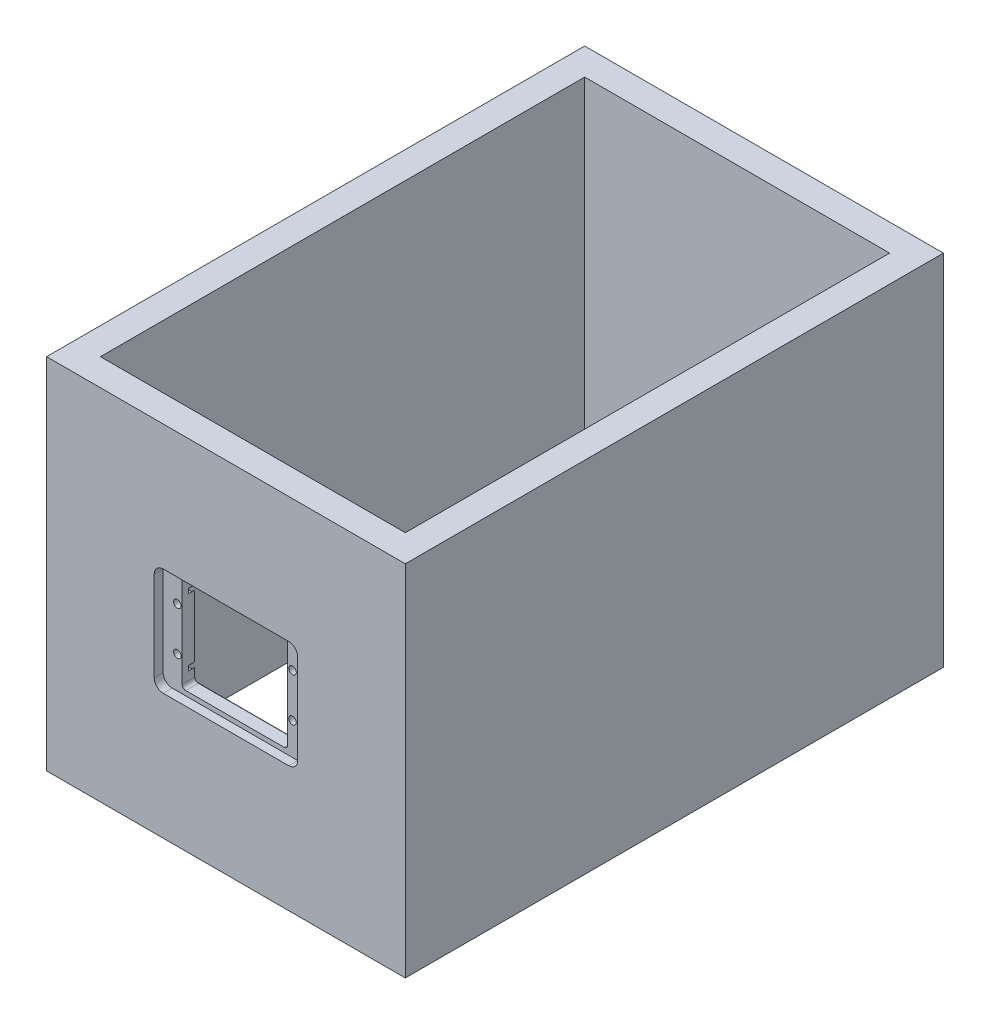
ISO-10303-21;
HEADER;
FILE_DESCRIPTION(('STEP AP214'),'2;1');
FILE_NAME('part.step','',(''),(''),'','','');
FILE_SCHEMA(('AUTOMOTIVE_DESIGN { 1 0 10303 214 1 1 1 1 }'));
ENDSEC;
DATA;
#1=APPLICATION_CONTEXT('core data for automotive mechanical design processes');
#2=APPLICATION_PROTOCOL_DEFINITION('international standard','automotive_design',2000,#1);
#3=PRODUCT_CONTEXT('',#1,'mechanical');
#4=PRODUCT('Part','Part','',(#3));
#5=PRODUCT_RELATED_PRODUCT_CATEGORY('part','',(#4));
#6=PRODUCT_DEFINITION_FORMATION('','',#4);
#7=PRODUCT_DEFINITION_CONTEXT('part definition',#1,'design');
#8=PRODUCT_DEFINITION('design','',#6,#7);
#9=PRODUCT_DEFINITION_SHAPE('','',#8);
#10=(LENGTH_UNIT() NAMED_UNIT(*) SI_UNIT(.MILLI.,.METRE.));
#11=(NAMED_UNIT(*) PLANE_ANGLE_UNIT() SI_UNIT($,.RADIAN.));
#12=(NAMED_UNIT(*) SI_UNIT($,.STERADIAN.) SOLID_ANGLE_UNIT());
#13=UNCERTAINTY_MEASURE_WITH_UNIT(LENGTH_MEASURE(1.E-05),#10,'distance_accuracy_value','');
#14=(GEOMETRIC_REPRESENTATION_CONTEXT(3) GLOBAL_UNCERTAINTY_ASSIGNED_CONTEXT((#13)) GLOBAL_UNIT_ASSIGNED_CONTEXT((#10,
#11,#12)) REPRESENTATION_CONTEXT('',''));
#15=CARTESIAN_POINT('',(0.,0.,0.));
#16=DIRECTION('',(0.,0.,1.));
#17=DIRECTION('',(1.,0.,0.));
#18=AXIS2_PLACEMENT_3D('',#15,#16,#17);
#19=CARTESIAN_POINT('',(29.4,25.4,300.001));
#20=DIRECTION('',(1.,0.,0.));
#21=DIRECTION('',(0.,1.,0.));
#22=AXIS2_PLACEMENT_3D('',#19,#20,#21);
#23=PLANE('',#22);
#24=DIRECTION('',(0.,0.,-1.));
#25=VECTOR('',#24,1.);
#26=CARTESIAN_POINT('',(29.4,-20.7076696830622,291.5));
#27=LINE('',#26,#25);
#28=CARTESIAN_POINT('',(29.4,-20.7076696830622,288.));
#29=VERTEX_POINT('',#28);
#30=CARTESIAN_POINT('',(29.4,-20.7076696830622,291.5));
#31=VERTEX_POINT('',#30);
#32=EDGE_CURVE('E627',#29,#31,#27,.F.);
#33=ORIENTED_EDGE('',*,*,#32,.F.);
#34=DIRECTION('',(0.,1.,0.));
#35=VECTOR('',#34,1.);
#36=CARTESIAN_POINT('',(29.4,25.4,288.));
#37=LINE('',#36,#35);
#38=CARTESIAN_POINT('',(29.4,-25.4,288.));
#39=VERTEX_POINT('',#38);
#40=EDGE_CURVE('E342',#39,#29,#37,.T.);
#41=ORIENTED_EDGE('',*,*,#40,.F.);
#42=DIRECTION('',(0.,0.,-1.));
#43=VECTOR('',#42,1.);
#44=CARTESIAN_POINT('',(29.4,-25.4,300.001));
#45=LINE('',#44,#43);
#46=CARTESIAN_POINT('',(29.4,-25.4,295.));
#47=VERTEX_POINT('',#46);
#48=EDGE_CURVE('E491',#47,#39,#45,.T.);
#49=ORIENTED_EDGE('',*,*,#48,.F.);
#50=DIRECTION('',(0.,-1.,0.));
#51=VECTOR('',#50,1.);
#52=CARTESIAN_POINT('',(29.4,25.4,295.));
#53=LINE('',#52,#51);
#54=CARTESIAN_POINT('',(29.4,25.4,295.));
#55=VERTEX_POINT('',#54);
#56=EDGE_CURVE('E469',#55,#47,#53,.T.);
#57=ORIENTED_EDGE('',*,*,#56,.F.);
#58=DIRECTION('',(0.,0.,-1.));
#59=VECTOR('',#58,1.);
#60=CARTESIAN_POINT('',(29.4,25.4,300.001));
#61=LINE('',#60,#59);
#62=CARTESIAN_POINT('',(29.4,25.4,288.));
#63=VERTEX_POINT('',#62);
#64=EDGE_CURVE('E495',#55,#63,#61,.T.);
#65=ORIENTED_EDGE('',*,*,#64,.T.);
#66=CARTESIAN_POINT('',(29.4,20.7076696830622,288.));
#67=VERTEX_POINT('',#66);
#68=EDGE_CURVE('E341',#67,#63,#37,.T.);
#69=ORIENTED_EDGE('',*,*,#68,.F.);
#70=DIRECTION('',(0.,0.,-1.));
#71=VECTOR('',#70,1.);
#72=CARTESIAN_POINT('',(29.4,20.7076696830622,291.5));
#73=LINE('',#72,#71);
#74=CARTESIAN_POINT('',(29.4,20.7076696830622,291.5));
#75=VERTEX_POINT('',#74);
#76=EDGE_CURVE('E904',#75,#67,#73,.T.);
#77=ORIENTED_EDGE('',*,*,#76,.F.);
#78=DIRECTION('',(0.,1.,0.));
#79=VECTOR('',#78,1.);
#80=CARTESIAN_POINT('',(29.4,0.,291.5));
#81=LINE('',#80,#79);
#82=CARTESIAN_POINT('',(29.4,18.0923303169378,291.5));
#83=VERTEX_POINT('',#82);
#84=EDGE_CURVE('E905',#83,#75,#81,.T.);
#85=ORIENTED_EDGE('',*,*,#84,.F.);
#86=DIRECTION('',(0.,0.,-1.));
#87=VECTOR('',#86,1.);
#88=CARTESIAN_POINT('',(29.4,18.0923303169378,291.5));
#89=LINE('',#88,#87);
#90=CARTESIAN_POINT('',(29.4,18.0923303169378,288.));
#91=VERTEX_POINT('',#90);
#92=EDGE_CURVE('E899',#83,#91,#89,.T.);
#93=ORIENTED_EDGE('',*,*,#92,.T.);
#94=CARTESIAN_POINT('',(29.4,-18.0923303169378,288.));
#95=VERTEX_POINT('',#94);
#96=EDGE_CURVE('E347',#95,#91,#37,.T.);
#97=ORIENTED_EDGE('',*,*,#96,.F.);
#98=DIRECTION('',(0.,0.,-1.));
#99=VECTOR('',#98,1.);
#100=CARTESIAN_POINT('',(29.4,-18.0923303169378,291.5));
#101=LINE('',#100,#99);
#102=CARTESIAN_POINT('',(29.4,-18.0923303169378,291.5));
#103=VERTEX_POINT('',#102);
#104=EDGE_CURVE('E631',#103,#95,#101,.T.);
#105=ORIENTED_EDGE('',*,*,#104,.F.);
#106=DIRECTION('',(0.,-1.,0.));
#107=VECTOR('',#106,1.);
#108=CARTESIAN_POINT('',(29.4,25.4,291.5));
#109=LINE('',#108,#107);
#110=EDGE_CURVE('E11',#103,#31,#109,.T.);
#111=ORIENTED_EDGE('',*,*,#110,.T.);
#112=EDGE_LOOP('',(#33,#41,#49,#57,#65,#69,#77,#85,#93,#97,#105,#111));
#113=FACE_BOUND('',#112,.T.);
#114=ADVANCED_FACE('F41',(#113),#23,.F.);
#115=CARTESIAN_POINT('',(33.25,-25.25,288.));
#116=DIRECTION('',(0.,0.,-1.));
#117=DIRECTION('',(-1.,0.,0.));
#118=AXIS2_PLACEMENT_3D('',#115,#116,#117);
#119=PLANE('',#118);
#120=CARTESIAN_POINT('',(-32.1,17.9,288.));
#121=DIRECTION('',(0.,0.,-1.));
#122=DIRECTION('',(-1.,0.,0.));
#123=AXIS2_PLACEMENT_3D('',#120,#121,#122);
#124=CIRCLE('',#123,3.);
#125=CARTESIAN_POINT('',(-29.4,16.5923303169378,288.));
#126=VERTEX_POINT('',#125);
#127=CARTESIAN_POINT('',(-29.4,19.2076696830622,288.));
#128=VERTEX_POINT('',#127);
#129=EDGE_CURVE('E319',#126,#128,#124,.T.);
#130=ORIENTED_EDGE('',*,*,#129,.F.);
#131=DIRECTION('',(0.,-1.,0.));
#132=VECTOR('',#131,1.);
#133=CARTESIAN_POINT('',(-29.4,25.4,288.));
#134=LINE('',#133,#132);
#135=CARTESIAN_POINT('',(-29.4,-18.0923303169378,288.));
#136=VERTEX_POINT('',#135);
#137=EDGE_CURVE('E313',#126,#136,#134,.T.);
#138=ORIENTED_EDGE('',*,*,#137,.T.);
#139=CARTESIAN_POINT('',(-32.1,-19.4,288.));
#140=DIRECTION('',(0.,0.,-1.));
#141=DIRECTION('',(-1.,0.,0.));
#142=AXIS2_PLACEMENT_3D('',#139,#140,#141);
#143=CIRCLE('',#142,3.);
#144=CARTESIAN_POINT('',(-29.4,-20.7076696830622,288.));
#145=VERTEX_POINT('',#144);
#146=EDGE_CURVE('E297',#145,#136,#143,.T.);
#147=ORIENTED_EDGE('',*,*,#146,.F.);
#148=CARTESIAN_POINT('',(-29.4,-25.4,288.));
#149=VERTEX_POINT('',#148);
#150=EDGE_CURVE('E322',#145,#149,#134,.T.);
#151=ORIENTED_EDGE('',*,*,#150,.T.);
#152=CARTESIAN_POINT('',(-27.4,-25.4,288.));
#153=DIRECTION('',(0.,0.,-1.));
#154=DIRECTION('',(-1.,0.,0.));
#155=AXIS2_PLACEMENT_3D('',#152,#153,#154);
#156=CIRCLE('',#155,2.);
#157=CARTESIAN_POINT('',(-27.4,-27.4,288.));
#158=VERTEX_POINT('',#157);
#159=EDGE_CURVE('E353',#149,#158,#156,.F.);
#160=ORIENTED_EDGE('',*,*,#159,.T.);
#161=DIRECTION('',(1.,0.,0.));
#162=VECTOR('',#161,1.);
#163=CARTESIAN_POINT('',(-27.4,-27.4,288.));
#164=LINE('',#163,#162);
#165=CARTESIAN_POINT('',(27.4,-27.4,288.));
#166=VERTEX_POINT('',#165);
#167=EDGE_CURVE('E350',#158,#166,#164,.T.);
#168=ORIENTED_EDGE('',*,*,#167,.T.);
#169=CARTESIAN_POINT('',(27.4,-25.4,288.));
#170=DIRECTION('',(0.,0.,-1.));
#171=DIRECTION('',(-1.,0.,0.));
#172=AXIS2_PLACEMENT_3D('',#169,#170,#171);
#173=CIRCLE('',#172,2.);
#174=EDGE_CURVE('E346',#166,#39,#173,.F.);
#175=ORIENTED_EDGE('',*,*,#174,.T.);
#176=ORIENTED_EDGE('',*,*,#40,.T.);
#177=CARTESIAN_POINT('',(32.1,-19.4,288.));
#178=DIRECTION('',(0.,0.,-1.));
#179=DIRECTION('',(-1.,0.,0.));
#180=AXIS2_PLACEMENT_3D('',#177,#178,#179);
#181=CIRCLE('',#180,3.);
#182=EDGE_CURVE('E607',#29,#95,#181,.F.);
#183=ORIENTED_EDGE('',*,*,#182,.T.);
#184=ORIENTED_EDGE('',*,*,#96,.T.);
#185=CARTESIAN_POINT('',(32.1,19.4,288.));
#186=DIRECTION('',(0.,0.,-1.));
#187=DIRECTION('',(-1.,0.,0.));
#188=AXIS2_PLACEMENT_3D('',#185,#186,#187);
#189=CIRCLE('',#188,3.);
#190=EDGE_CURVE('E305',#67,#91,#189,.T.);
#191=ORIENTED_EDGE('',*,*,#190,.F.);
#192=ORIENTED_EDGE('',*,*,#68,.T.);
#193=CARTESIAN_POINT('',(27.4,25.4,288.));
#194=DIRECTION('',(0.,0.,-1.));
#195=DIRECTION('',(-1.,0.,0.));
#196=AXIS2_PLACEMENT_3D('',#193,#194,#195);
#197=CIRCLE('',#196,2.);
#198=CARTESIAN_POINT('',(27.4,27.4,288.));
#199=VERTEX_POINT('',#198);
#200=EDGE_CURVE('E338',#63,#199,#197,.F.);
#201=ORIENTED_EDGE('',*,*,#200,.T.);
#202=DIRECTION('',(-1.,0.,0.));
#203=VECTOR('',#202,1.);
#204=CARTESIAN_POINT('',(-27.4,27.4,288.));
#205=LINE('',#204,#203);
#206=CARTESIAN_POINT('',(-27.4,27.4,288.));
#207=VERTEX_POINT('',#206);
#208=EDGE_CURVE('E335',#199,#207,#205,.T.);
#209=ORIENTED_EDGE('',*,*,#208,.T.);
#210=CARTESIAN_POINT('',(-27.4,25.4,288.));
#211=DIRECTION('',(0.,0.,-1.));
#212=DIRECTION('',(-1.,0.,0.));
#213=AXIS2_PLACEMENT_3D('',#210,#211,#212);
#214=CIRCLE('',#213,2.);
#215=CARTESIAN_POINT('',(-29.4,25.4,288.));
#216=VERTEX_POINT('',#215);
#217=EDGE_CURVE('E328',#207,#216,#214,.F.);
#218=ORIENTED_EDGE('',*,*,#217,.T.);
#219=EDGE_CURVE('E321',#216,#128,#134,.T.);
#220=ORIENTED_EDGE('',*,*,#219,.T.);
#221=EDGE_LOOP('',(#130,#138,#147,#151,#160,#168,#175,#176,#183,#184,#191,#192,#201,#209,#218,#220));
#222=FACE_BOUND('',#221,.T.);
#223=CARTESIAN_POINT('',(32.1,12.1,288.));
#224=DIRECTION('',(0.,0.,-1.));
#225=DIRECTION('',(-1.,0.,0.));
#226=AXIS2_PLACEMENT_3D('',#223,#224,#225);
#227=CIRCLE('',#226,2.1);
#228=CARTESIAN_POINT('',(30.,12.1,288.));
#229=VERTEX_POINT('',#228);
#230=EDGE_CURVE('E329',#229,#229,#227,.F.);
#231=ORIENTED_EDGE('',*,*,#230,.T.);
#232=EDGE_LOOP('',(#231));
#233=FACE_BOUND('',#232,.T.);
#234=CARTESIAN_POINT('',(-32.1,12.1,288.));
#235=DIRECTION('',(0.,0.,-1.));
#236=DIRECTION('',(-1.,0.,0.));
#237=AXIS2_PLACEMENT_3D('',#234,#235,#236);
#238=CIRCLE('',#237,2.1);
#239=CARTESIAN_POINT('',(-34.2,12.1,288.));
#240=VERTEX_POINT('',#239);
#241=EDGE_CURVE('E723',#240,#240,#238,.F.);
#242=ORIENTED_EDGE('',*,*,#241,.T.);
#243=EDGE_LOOP('',(#242));
#244=FACE_BOUND('',#243,.T.);
#245=CARTESIAN_POINT('',(-32.1,-12.1,288.));
#246=DIRECTION('',(0.,0.,-1.));
#247=DIRECTION('',(-1.,0.,0.));
#248=AXIS2_PLACEMENT_3D('',#245,#246,#247);
#249=CIRCLE('',#248,2.1);
#250=CARTESIAN_POINT('',(-34.2,-12.1,288.));
#251=VERTEX_POINT('',#250);
#252=EDGE_CURVE('E615',#251,#251,#249,.F.);
#253=ORIENTED_EDGE('',*,*,#252,.T.);
#254=EDGE_LOOP('',(#253));
#255=FACE_BOUND('',#254,.T.);
#256=CARTESIAN_POINT('',(32.1,-12.1,288.));
#257=DIRECTION('',(0.,0.,-1.));
#258=DIRECTION('',(-1.,0.,0.));
#259=AXIS2_PLACEMENT_3D('',#256,#257,#258);
#260=CIRCLE('',#259,2.1);
#261=CARTESIAN_POINT('',(30.,-12.1,288.));
#262=VERTEX_POINT('',#261);
#263=EDGE_CURVE('E611',#262,#262,#260,.F.);
#264=ORIENTED_EDGE('',*,*,#263,.T.);
#265=EDGE_LOOP('',(#264));
#266=FACE_BOUND('',#265,.T.);
#267=CARTESIAN_POINT('',(33.25,-25.25,288.));
#268=DIRECTION('',(0.,0.,-1.));
#269=DIRECTION('',(-1.,0.,0.));
#270=AXIS2_PLACEMENT_3D('',#267,#268,#269);
#271=CIRCLE('',#270,5.);
#272=CARTESIAN_POINT('',(38.25,-25.25,288.));
#273=VERTEX_POINT('',#272);
#274=CARTESIAN_POINT('',(33.2499999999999,-30.25,288.));
#275=VERTEX_POINT('',#274);
#276=EDGE_CURVE('E635',#273,#275,#271,.T.);
#277=ORIENTED_EDGE('',*,*,#276,.T.);
#278=DIRECTION('',(-1.,0.,0.));
#279=VECTOR('',#278,1.);
#280=CARTESIAN_POINT('',(33.2499999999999,-30.25,288.));
#281=LINE('',#280,#279);
#282=CARTESIAN_POINT('',(-33.25,-30.25,288.));
#283=VERTEX_POINT('',#282);
#284=EDGE_CURVE('E639',#275,#283,#281,.T.);
#285=ORIENTED_EDGE('',*,*,#284,.T.);
#286=CARTESIAN_POINT('',(-33.25,-25.25,288.));
#287=DIRECTION('',(0.,0.,-1.));
#288=DIRECTION('',(-1.,0.,0.));
#289=AXIS2_PLACEMENT_3D('',#286,#287,#288);
#290=CIRCLE('',#289,5.);
#291=CARTESIAN_POINT('',(-38.25,-25.25,288.));
#292=VERTEX_POINT('',#291);
#293=EDGE_CURVE('E644',#283,#292,#290,.T.);
#294=ORIENTED_EDGE('',*,*,#293,.T.);
#295=DIRECTION('',(0.,1.,0.));
#296=VECTOR('',#295,1.);
#297=CARTESIAN_POINT('',(-38.25,25.25,288.));
#298=LINE('',#297,#296);
#299=CARTESIAN_POINT('',(-38.25,25.25,288.));
#300=VERTEX_POINT('',#299);
#301=EDGE_CURVE('E648',#292,#300,#298,.T.);
#302=ORIENTED_EDGE('',*,*,#301,.T.);
#303=CARTESIAN_POINT('',(-33.25,25.25,288.));
#304=DIRECTION('',(0.,0.,-1.));
#305=DIRECTION('',(1.,0.,0.));
#306=AXIS2_PLACEMENT_3D('',#303,#304,#305);
#307=CIRCLE('',#306,5.);
#308=CARTESIAN_POINT('',(-33.25,30.25,288.));
#309=VERTEX_POINT('',#308);
#310=EDGE_CURVE('E652',#300,#309,#307,.T.);
#311=ORIENTED_EDGE('',*,*,#310,.T.);
#312=DIRECTION('',(1.,0.,0.));
#313=VECTOR('',#312,1.);
#314=CARTESIAN_POINT('',(33.25,30.25,288.));
#315=LINE('',#314,#313);
#316=CARTESIAN_POINT('',(33.25,30.25,288.));
#317=VERTEX_POINT('',#316);
#318=EDGE_CURVE('E656',#309,#317,#315,.T.);
#319=ORIENTED_EDGE('',*,*,#318,.T.);
#320=CARTESIAN_POINT('',(33.25,25.25,288.));
#321=DIRECTION('',(0.,0.,-1.));
#322=DIRECTION('',(-1.,0.,0.));
#323=AXIS2_PLACEMENT_3D('',#320,#321,#322);
#324=CIRCLE('',#323,5.);
#325=CARTESIAN_POINT('',(38.25,25.25,288.));
#326=VERTEX_POINT('',#325);
#327=EDGE_CURVE('E660',#317,#326,#324,.T.);
#328=ORIENTED_EDGE('',*,*,#327,.T.);
#329=DIRECTION('',(0.,-1.,0.));
#330=VECTOR('',#329,1.);
#331=CARTESIAN_POINT('',(38.25,25.25,288.));
#332=LINE('',#331,#330);
#333=EDGE_CURVE('E664',#326,#273,#332,.T.);
#334=ORIENTED_EDGE('',*,*,#333,.T.);
#335=EDGE_LOOP('',(#277,#285,#294,#302,#311,#319,#328,#334));
#336=FACE_BOUND('',#335,.T.);
#337=ADVANCED_FACE('F316',(#222,#233,#244,#255,#266,#336),#119,.T.);
#338=CARTESIAN_POINT('',(-27.4,-25.4,300.001));
#339=DIRECTION('',(0.,0.,-1.));
#340=DIRECTION('',(-1.,0.,0.));
#341=AXIS2_PLACEMENT_3D('',#338,#339,#340);
#342=CYLINDRICAL_SURFACE('',#341,2.);
#343=ORIENTED_EDGE('',*,*,#159,.F.);
#344=DIRECTION('',(0.,0.,-1.));
#345=VECTOR('',#344,1.);
#346=CARTESIAN_POINT('',(-29.4,-25.4,300.001));
#347=LINE('',#346,#345);
#348=CARTESIAN_POINT('',(-29.4,-25.4,295.));
#349=VERTEX_POINT('',#348);
#350=EDGE_CURVE('E481',#349,#149,#347,.T.);
#351=ORIENTED_EDGE('',*,*,#350,.F.);
#352=CARTESIAN_POINT('',(-27.4,-25.4,295.));
#353=DIRECTION('',(0.,0.,1.));
#354=DIRECTION('',(1.,0.,0.));
#355=AXIS2_PLACEMENT_3D('',#352,#353,#354);
#356=CIRCLE('',#355,2.);
#357=CARTESIAN_POINT('',(-27.4,-27.4,295.));
#358=VERTEX_POINT('',#357);
#359=EDGE_CURVE('E478',#358,#349,#356,.F.);
#360=ORIENTED_EDGE('',*,*,#359,.F.);
#361=DIRECTION('',(0.,0.,-1.));
#362=VECTOR('',#361,1.);
#363=CARTESIAN_POINT('',(-27.4,-27.4,300.001));
#364=LINE('',#363,#362);
#365=EDGE_CURVE('E482',#358,#158,#364,.T.);
#366=ORIENTED_EDGE('',*,*,#365,.T.);
#367=EDGE_LOOP('',(#343,#351,#360,#366));
#368=FACE_BOUND('',#367,.T.);
#369=ADVANCED_FACE('F758',(#368),#342,.F.);
#370=CARTESIAN_POINT('',(-27.4,-27.4,300.001));
#371=DIRECTION('',(0.,-1.,0.));
#372=DIRECTION('',(0.,0.,-1.));
#373=AXIS2_PLACEMENT_3D('',#370,#371,#372);
#374=PLANE('',#373);
#375=ORIENTED_EDGE('',*,*,#167,.F.);
#376=ORIENTED_EDGE('',*,*,#365,.F.);
#377=DIRECTION('',(-1.,0.,0.));
#378=VECTOR('',#377,1.);
#379=CARTESIAN_POINT('',(-27.4,-27.4,295.));
#380=LINE('',#379,#378);
#381=CARTESIAN_POINT('',(27.4,-27.4,295.));
#382=VERTEX_POINT('',#381);
#383=EDGE_CURVE('E475',#382,#358,#380,.T.);
#384=ORIENTED_EDGE('',*,*,#383,.F.);
#385=DIRECTION('',(0.,0.,-1.));
#386=VECTOR('',#385,1.);
#387=CARTESIAN_POINT('',(27.4,-27.4,300.001));
#388=LINE('',#387,#386);
#389=EDGE_CURVE('E487',#382,#166,#388,.T.);
#390=ORIENTED_EDGE('',*,*,#389,.T.);
#391=EDGE_LOOP('',(#375,#376,#384,#390));
#392=FACE_BOUND('',#391,.T.);
#393=ADVANCED_FACE('F778',(#392),#374,.F.);
#394=CARTESIAN_POINT('',(27.4,-25.4,300.001));
#395=DIRECTION('',(0.,0.,-1.));
#396=DIRECTION('',(-1.,0.,0.));
#397=AXIS2_PLACEMENT_3D('',#394,#395,#396);
#398=CYLINDRICAL_SURFACE('',#397,2.);
#399=ORIENTED_EDGE('',*,*,#174,.F.);
#400=ORIENTED_EDGE('',*,*,#389,.F.);
#401=CARTESIAN_POINT('',(27.4,-25.4,295.));
#402=DIRECTION('',(0.,0.,1.));
#403=DIRECTION('',(1.,0.,0.));
#404=AXIS2_PLACEMENT_3D('',#401,#402,#403);
#405=CIRCLE('',#404,2.);
#406=EDGE_CURVE('E472',#47,#382,#405,.F.);
#407=ORIENTED_EDGE('',*,*,#406,.F.);
#408=ORIENTED_EDGE('',*,*,#48,.T.);
#409=EDGE_LOOP('',(#399,#400,#407,#408));
#410=FACE_BOUND('',#409,.T.);
#411=ADVANCED_FACE('F763',(#410),#398,.F.);
#412=CARTESIAN_POINT('',(27.4,25.4,300.001));
#413=DIRECTION('',(0.,0.,-1.));
#414=DIRECTION('',(-1.,0.,0.));
#415=AXIS2_PLACEMENT_3D('',#412,#413,#414);
#416=CYLINDRICAL_SURFACE('',#415,2.);
#417=ORIENTED_EDGE('',*,*,#200,.F.);
#418=ORIENTED_EDGE('',*,*,#64,.F.);
#419=CARTESIAN_POINT('',(27.4,25.4,295.));
#420=DIRECTION('',(0.,0.,1.));
#421=DIRECTION('',(1.,0.,0.));
#422=AXIS2_PLACEMENT_3D('',#419,#420,#421);
#423=CIRCLE('',#422,2.);
#424=CARTESIAN_POINT('',(27.4,27.4,295.));
#425=VERTEX_POINT('',#424);
#426=EDGE_CURVE('E466',#425,#55,#423,.F.);
#427=ORIENTED_EDGE('',*,*,#426,.F.);
#428=DIRECTION('',(0.,0.,-1.));
#429=VECTOR('',#428,1.);
#430=CARTESIAN_POINT('',(27.4,27.4,300.001));
#431=LINE('',#430,#429);
#432=EDGE_CURVE('E499',#425,#199,#431,.T.);
#433=ORIENTED_EDGE('',*,*,#432,.T.);
#434=EDGE_LOOP('',(#417,#418,#427,#433));
#435=FACE_BOUND('',#434,.T.);
#436=ADVANCED_FACE('F765',(#435),#416,.F.);
#437=CARTESIAN_POINT('',(-27.4,27.4,300.001));
#438=DIRECTION('',(0.,1.,0.));
#439=DIRECTION('',(-1.,0.,0.));
#440=AXIS2_PLACEMENT_3D('',#437,#438,#439);
#441=PLANE('',#440);
#442=ORIENTED_EDGE('',*,*,#208,.F.);
#443=ORIENTED_EDGE('',*,*,#432,.F.);
#444=DIRECTION('',(1.,0.,0.));
#445=VECTOR('',#444,1.);
#446=CARTESIAN_POINT('',(-27.4,27.4,295.));
#447=LINE('',#446,#445);
#448=CARTESIAN_POINT('',(-27.4,27.4,295.));
#449=VERTEX_POINT('',#448);
#450=EDGE_CURVE('E463',#449,#425,#447,.T.);
#451=ORIENTED_EDGE('',*,*,#450,.F.);
#452=DIRECTION('',(0.,0.,-1.));
#453=VECTOR('',#452,1.);
#454=CARTESIAN_POINT('',(-27.4,27.4,300.001));
#455=LINE('',#454,#453);
#456=EDGE_CURVE('E503',#449,#207,#455,.T.);
#457=ORIENTED_EDGE('',*,*,#456,.T.);
#458=EDGE_LOOP('',(#442,#443,#451,#457));
#459=FACE_BOUND('',#458,.T.);
#460=ADVANCED_FACE('F768',(#459),#441,.F.);
#461=CARTESIAN_POINT('',(-27.4,25.4,300.001));
#462=DIRECTION('',(0.,0.,-1.));
#463=DIRECTION('',(-1.,0.,0.));
#464=AXIS2_PLACEMENT_3D('',#461,#462,#463);
#465=CYLINDRICAL_SURFACE('',#464,2.);
#466=ORIENTED_EDGE('',*,*,#217,.F.);
#467=ORIENTED_EDGE('',*,*,#456,.F.);
#468=CARTESIAN_POINT('',(-27.4,25.4,295.));
#469=DIRECTION('',(0.,0.,1.));
#470=DIRECTION('',(1.,0.,0.));
#471=AXIS2_PLACEMENT_3D('',#468,#469,#470);
#472=CIRCLE('',#471,2.);
#473=CARTESIAN_POINT('',(-29.4,25.4,295.));
#474=VERTEX_POINT('',#473);
#475=EDGE_CURVE('E460',#474,#449,#472,.F.);
#476=ORIENTED_EDGE('',*,*,#475,.F.);
#477=DIRECTION('',(0.,0.,-1.));
#478=VECTOR('',#477,1.);
#479=CARTESIAN_POINT('',(-29.4,25.4,300.001));
#480=LINE('',#479,#478);
#481=EDGE_CURVE('E507',#474,#216,#480,.T.);
#482=ORIENTED_EDGE('',*,*,#481,.T.);
#483=EDGE_LOOP('',(#466,#467,#476,#482));
#484=FACE_BOUND('',#483,.T.);
#485=ADVANCED_FACE('F747',(#484),#465,.F.);
#486=CARTESIAN_POINT('',(-29.4,25.4,300.001));
#487=DIRECTION('',(-1.,0.,0.));
#488=DIRECTION('',(0.,0.,1.));
#489=AXIS2_PLACEMENT_3D('',#486,#487,#488);
#490=PLANE('',#489);
#491=DIRECTION('',(0.,-1.,0.));
#492=VECTOR('',#491,1.);
#493=CARTESIAN_POINT('',(-29.4,25.4,291.5));
#494=LINE('',#493,#492);
#495=CARTESIAN_POINT('',(-29.4,19.2076696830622,291.5));
#496=VERTEX_POINT('',#495);
#497=CARTESIAN_POINT('',(-29.4,16.5923303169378,291.5));
#498=VERTEX_POINT('',#497);
#499=EDGE_CURVE('E49',#496,#498,#494,.T.);
#500=ORIENTED_EDGE('',*,*,#499,.F.);
#501=DIRECTION('',(0.,0.,-1.));
#502=VECTOR('',#501,1.);
#503=CARTESIAN_POINT('',(-29.4,19.2076696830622,291.5));
#504=LINE('',#503,#502);
#505=EDGE_CURVE('E625',#496,#128,#504,.T.);
#506=ORIENTED_EDGE('',*,*,#505,.T.);
#507=ORIENTED_EDGE('',*,*,#219,.F.);
#508=ORIENTED_EDGE('',*,*,#481,.F.);
#509=DIRECTION('',(0.,1.,0.));
#510=VECTOR('',#509,1.);
#511=CARTESIAN_POINT('',(-29.4,25.4,295.));
#512=LINE('',#511,#510);
#513=EDGE_CURVE('E457',#349,#474,#512,.T.);
#514=ORIENTED_EDGE('',*,*,#513,.F.);
#515=ORIENTED_EDGE('',*,*,#350,.T.);
#516=ORIENTED_EDGE('',*,*,#150,.F.);
#517=DIRECTION('',(0.,0.,-1.));
#518=VECTOR('',#517,1.);
#519=CARTESIAN_POINT('',(-29.4,-20.7076696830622,291.5));
#520=LINE('',#519,#518);
#521=CARTESIAN_POINT('',(-29.4,-20.7076696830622,291.5));
#522=VERTEX_POINT('',#521);
#523=EDGE_CURVE('E56',#522,#145,#520,.T.);
#524=ORIENTED_EDGE('',*,*,#523,.F.);
#525=DIRECTION('',(0.,-1.,0.));
#526=VECTOR('',#525,1.);
#527=CARTESIAN_POINT('',(-29.4,0.,291.5));
#528=LINE('',#527,#526);
#529=CARTESIAN_POINT('',(-29.4,-18.0923303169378,291.5));
#530=VERTEX_POINT('',#529);
#531=EDGE_CURVE('E306',#530,#522,#528,.T.);
#532=ORIENTED_EDGE('',*,*,#531,.F.);
#533=DIRECTION('',(0.,0.,-1.));
#534=VECTOR('',#533,1.);
#535=CARTESIAN_POINT('',(-29.4,-18.0923303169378,291.5));
#536=LINE('',#535,#534);
#537=EDGE_CURVE('E300',#530,#136,#536,.T.);
#538=ORIENTED_EDGE('',*,*,#537,.T.);
#539=ORIENTED_EDGE('',*,*,#137,.F.);
#540=DIRECTION('',(0.,0.,-1.));
#541=VECTOR('',#540,1.);
#542=CARTESIAN_POINT('',(-29.4,16.5923303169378,291.5));
#543=LINE('',#542,#541);
#544=EDGE_CURVE('E64',#126,#498,#543,.F.);
#545=ORIENTED_EDGE('',*,*,#544,.T.);
#546=EDGE_LOOP('',(#500,#506,#507,#508,#514,#515,#516,#524,#532,#538,#539,#545));
#547=FACE_BOUND('',#546,.T.);
#548=ADVANCED_FACE('F312',(#547),#490,.F.);
#549=CARTESIAN_POINT('',(32.1,12.1,300.001));
#550=DIRECTION('',(0.,0.,-1.));
#551=DIRECTION('',(-1.,0.,0.));
#552=AXIS2_PLACEMENT_3D('',#549,#550,#551);
#553=CYLINDRICAL_SURFACE('',#552,2.1);
#554=CARTESIAN_POINT('',(32.1,12.1,295.));
#555=DIRECTION('',(0.,0.,1.));
#556=DIRECTION('',(1.,0.,0.));
#557=AXIS2_PLACEMENT_3D('',#554,#555,#556);
#558=CIRCLE('',#557,2.1);
#559=CARTESIAN_POINT('',(30.,12.1,295.));
#560=VERTEX_POINT('',#559);
#561=EDGE_CURVE('E453',#560,#560,#558,.F.);
#562=CARTESIAN_POINT('',(30.,12.1,295.));
#563=CARTESIAN_POINT('',(30.,12.1,294.927083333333));
#564=CARTESIAN_POINT('',(30.,12.1,294.854166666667));
#565=CARTESIAN_POINT('',(30.,12.1,294.708333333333));
#566=CARTESIAN_POINT('',(30.,12.1,294.635416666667));
#567=CARTESIAN_POINT('',(30.,12.1,294.489583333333));
#568=CARTESIAN_POINT('',(30.,12.1,294.416666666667));
#569=CARTESIAN_POINT('',(30.,12.1,294.270833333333));
#570=CARTESIAN_POINT('',(30.,12.1,294.197916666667));
#571=CARTESIAN_POINT('',(30.,12.1,294.052083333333));
#572=CARTESIAN_POINT('',(30.,12.1,293.979166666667));
#573=CARTESIAN_POINT('',(30.,12.1,293.833333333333));
#574=CARTESIAN_POINT('',(30.,12.1,293.760416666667));
#575=CARTESIAN_POINT('',(30.,12.1,293.614583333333));
#576=CARTESIAN_POINT('',(30.,12.1,293.541666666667));
#577=CARTESIAN_POINT('',(30.,12.1,293.395833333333));
#578=CARTESIAN_POINT('',(30.,12.1,293.322916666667));
#579=CARTESIAN_POINT('',(30.,12.1,293.177083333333));
#580=CARTESIAN_POINT('',(30.,12.1,293.104166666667));
#581=CARTESIAN_POINT('',(30.,12.1,292.958333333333));
#582=CARTESIAN_POINT('',(30.,12.1,292.885416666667));
#583=CARTESIAN_POINT('',(30.,12.1,292.739583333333));
#584=CARTESIAN_POINT('',(30.,12.1,292.666666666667));
#585=CARTESIAN_POINT('',(30.,12.1,292.520833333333));
#586=CARTESIAN_POINT('',(30.,12.1,292.447916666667));
#587=CARTESIAN_POINT('',(30.,12.1,292.302083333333));
#588=CARTESIAN_POINT('',(30.,12.1,292.229166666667));
#589=CARTESIAN_POINT('',(30.,12.1,292.083333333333));
#590=CARTESIAN_POINT('',(30.,12.1,292.010416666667));
#591=CARTESIAN_POINT('',(30.,12.1,291.864583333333));
#592=CARTESIAN_POINT('',(30.,12.1,291.791666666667));
#593=CARTESIAN_POINT('',(30.,12.1,291.645833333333));
#594=CARTESIAN_POINT('',(30.,12.1,291.572916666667));
#595=CARTESIAN_POINT('',(30.,12.1,291.427083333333));
#596=CARTESIAN_POINT('',(30.,12.1,291.354166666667));
#597=CARTESIAN_POINT('',(30.,12.1,291.208333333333));
#598=CARTESIAN_POINT('',(30.,12.1,291.135416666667));
#599=CARTESIAN_POINT('',(30.,12.1,290.989583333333));
#600=CARTESIAN_POINT('',(30.,12.1,290.916666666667));
#601=CARTESIAN_POINT('',(30.,12.1,290.770833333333));
#602=CARTESIAN_POINT('',(30.,12.1,290.697916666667));
#603=CARTESIAN_POINT('',(30.,12.1,290.552083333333));
#604=CARTESIAN_POINT('',(30.,12.1,290.479166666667));
#605=CARTESIAN_POINT('',(30.,12.1,290.333333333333));
#606=CARTESIAN_POINT('',(30.,12.1,290.260416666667));
#607=CARTESIAN_POINT('',(30.,12.1,290.114583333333));
#608=CARTESIAN_POINT('',(30.,12.1,290.041666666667));
#609=CARTESIAN_POINT('',(30.,12.1,289.895833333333));
#610=CARTESIAN_POINT('',(30.,12.1,289.822916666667));
#611=CARTESIAN_POINT('',(30.,12.1,289.677083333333));
#612=CARTESIAN_POINT('',(30.,12.1,289.604166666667));
#613=CARTESIAN_POINT('',(30.,12.1,289.458333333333));
#614=CARTESIAN_POINT('',(30.,12.1,289.385416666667));
#615=CARTESIAN_POINT('',(30.,12.1,289.239583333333));
#616=CARTESIAN_POINT('',(30.,12.1,289.166666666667));
#617=CARTESIAN_POINT('',(30.,12.1,289.020833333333));
#618=CARTESIAN_POINT('',(30.,12.1,288.947916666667));
#619=CARTESIAN_POINT('',(30.,12.1,288.802083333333));
#620=CARTESIAN_POINT('',(30.,12.1,288.729166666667));
#621=CARTESIAN_POINT('',(30.,12.1,288.583333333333));
#622=CARTESIAN_POINT('',(30.,12.1,288.510416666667));
#623=CARTESIAN_POINT('',(30.,12.1,288.364583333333));
#624=CARTESIAN_POINT('',(30.,12.1,288.291666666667));
#625=CARTESIAN_POINT('',(30.,12.1,288.145833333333));
#626=CARTESIAN_POINT('',(30.,12.1,288.072916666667));
#627=CARTESIAN_POINT('',(30.,12.1,288.));
#628=B_SPLINE_CURVE_WITH_KNOTS('',3,(#562,#563,#564,#565,#566,#567,#568,#569,#570,#571,#572,
#573,#574,#575,#576,#577,#578,#579,#580,#581,#582,#583,#584,#585,#586,#587,#588,#589,#590,#591,
#592,#593,#594,#595,#596,#597,#598,#599,#600,#601,#602,#603,#604,#605,#606,#607,#608,#609,#610,
#611,#612,#613,#614,#615,#616,#617,#618,#619,#620,#621,#622,#623,#624,#625,#626,#627),
.UNSPECIFIED.,.F.,.F.,(4,2,2,2,2,2,2,2,2,2,2,2,2,2,2,2,2,2,2,2,2,2,2,2,2,2,2,2,2,2,2,2,4),(0.,
0.218750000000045,0.437500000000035,0.656250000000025,0.875000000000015,1.09375,
1.31249999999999,1.53125000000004,1.75000000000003,1.96875000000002,2.18750000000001,2.40625,
2.62499999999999,2.84375000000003,3.06250000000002,3.28125000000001,3.5,3.71874999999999,
3.93749999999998,4.15624999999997,4.37500000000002,4.59375000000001,4.8125,5.03124999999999,
5.24999999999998,5.46874999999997,5.68750000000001,5.90625,6.12499999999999,6.34374999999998,
6.56249999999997,6.78124999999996,7.00000000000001),.UNSPECIFIED.);
#629=EDGE_CURVE('BSEAM734',#560,#229,#628,.T.);
#630=ORIENTED_EDGE('',*,*,#561,.F.);
#631=ORIENTED_EDGE('',*,*,#230,.F.);
#632=ORIENTED_EDGE('',*,*,#629,.T.);
#633=ORIENTED_EDGE('',*,*,#629,.F.);
#634=EDGE_LOOP('',(#630,#632,#631,#633));
#635=FACE_BOUND('',#634,.T.);
#636=ADVANCED_FACE('F734',(#635),#553,.F.);
#637=CARTESIAN_POINT('',(-32.1,12.1,300.001));
#638=DIRECTION('',(0.,0.,-1.));
#639=DIRECTION('',(-1.,0.,0.));
#640=AXIS2_PLACEMENT_3D('',#637,#638,#639);
#641=CYLINDRICAL_SURFACE('',#640,2.1);
#642=CARTESIAN_POINT('',(-32.1,12.1,295.));
#643=DIRECTION('',(0.,0.,1.));
#644=DIRECTION('',(1.,0.,0.));
#645=AXIS2_PLACEMENT_3D('',#642,#643,#644);
#646=CIRCLE('',#645,2.1);
#647=CARTESIAN_POINT('',(-34.2,12.1,295.));
#648=VERTEX_POINT('',#647);
#649=EDGE_CURVE('E449',#648,#648,#646,.F.);
#650=CARTESIAN_POINT('',(-34.2,12.1,295.));
#651=CARTESIAN_POINT('',(-34.2,12.1,294.927083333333));
#652=CARTESIAN_POINT('',(-34.2,12.1,294.854166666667));
#653=CARTESIAN_POINT('',(-34.2,12.1,294.708333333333));
#654=CARTESIAN_POINT('',(-34.2,12.1,294.635416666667));
#655=CARTESIAN_POINT('',(-34.2,12.1,294.489583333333));
#656=CARTESIAN_POINT('',(-34.2,12.1,294.416666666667));
#657=CARTESIAN_POINT('',(-34.2,12.1,294.270833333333));
#658=CARTESIAN_POINT('',(-34.2,12.1,294.197916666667));
#659=CARTESIAN_POINT('',(-34.2,12.1,294.052083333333));
#660=CARTESIAN_POINT('',(-34.2,12.1,293.979166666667));
#661=CARTESIAN_POINT('',(-34.2,12.1,293.833333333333));
#662=CARTESIAN_POINT('',(-34.2,12.1,293.760416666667));
#663=CARTESIAN_POINT('',(-34.2,12.1,293.614583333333));
#664=CARTESIAN_POINT('',(-34.2,12.1,293.541666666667));
#665=CARTESIAN_POINT('',(-34.2,12.1,293.395833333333));
#666=CARTESIAN_POINT('',(-34.2,12.1,293.322916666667));
#667=CARTESIAN_POINT('',(-34.2,12.1,293.177083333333));
#668=CARTESIAN_POINT('',(-34.2,12.1,293.104166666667));
#669=CARTESIAN_POINT('',(-34.2,12.1,292.958333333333));
#670=CARTESIAN_POINT('',(-34.2,12.1,292.885416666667));
#671=CARTESIAN_POINT('',(-34.2,12.1,292.739583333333));
#672=CARTESIAN_POINT('',(-34.2,12.1,292.666666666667));
#673=CARTESIAN_POINT('',(-34.2,12.1,292.520833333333));
#674=CARTESIAN_POINT('',(-34.2,12.1,292.447916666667));
#675=CARTESIAN_POINT('',(-34.2,12.1,292.302083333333));
#676=CARTESIAN_POINT('',(-34.2,12.1,292.229166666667));
#677=CARTESIAN_POINT('',(-34.2,12.1,292.083333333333));
#678=CARTESIAN_POINT('',(-34.2,12.1,292.010416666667));
#679=CARTESIAN_POINT('',(-34.2,12.1,291.864583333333));
#680=CARTESIAN_POINT('',(-34.2,12.1,291.791666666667));
#681=CARTESIAN_POINT('',(-34.2,12.1,291.645833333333));
#682=CARTESIAN_POINT('',(-34.2,12.1,291.572916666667));
#683=CARTESIAN_POINT('',(-34.2,12.1,291.427083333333));
#684=CARTESIAN_POINT('',(-34.2,12.1,291.354166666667));
#685=CARTESIAN_POINT('',(-34.2,12.1,291.208333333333));
#686=CARTESIAN_POINT('',(-34.2,12.1,291.135416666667));
#687=CARTESIAN_POINT('',(-34.2,12.1,290.989583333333));
#688=CARTESIAN_POINT('',(-34.2,12.1,290.916666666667));
#689=CARTESIAN_POINT('',(-34.2,12.1,290.770833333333));
#690=CARTESIAN_POINT('',(-34.2,12.1,290.697916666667));
#691=CARTESIAN_POINT('',(-34.2,12.1,290.552083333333));
#692=CARTESIAN_POINT('',(-34.2,12.1,290.479166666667));
#693=CARTESIAN_POINT('',(-34.2,12.1,290.333333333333));
#694=CARTESIAN_POINT('',(-34.2,12.1,290.260416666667));
#695=CARTESIAN_POINT('',(-34.2,12.1,290.114583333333));
#696=CARTESIAN_POINT('',(-34.2,12.1,290.041666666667));
#697=CARTESIAN_POINT('',(-34.2,12.1,289.895833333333));
#698=CARTESIAN_POINT('',(-34.2,12.1,289.822916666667));
#699=CARTESIAN_POINT('',(-34.2,12.1,289.677083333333));
#700=CARTESIAN_POINT('',(-34.2,12.1,289.604166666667));
#701=CARTESIAN_POINT('',(-34.2,12.1,289.458333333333));
#702=CARTESIAN_POINT('',(-34.2,12.1,289.385416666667));
#703=CARTESIAN_POINT('',(-34.2,12.1,289.239583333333));
#704=CARTESIAN_POINT('',(-34.2,12.1,289.166666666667));
#705=CARTESIAN_POINT('',(-34.2,12.1,289.020833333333));
#706=CARTESIAN_POINT('',(-34.2,12.1,288.947916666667));
#707=CARTESIAN_POINT('',(-34.2,12.1,288.802083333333));
#708=CARTESIAN_POINT('',(-34.2,12.1,288.729166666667));
#709=CARTESIAN_POINT('',(-34.2,12.1,288.583333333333));
#710=CARTESIAN_POINT('',(-34.2,12.1,288.510416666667));
#711=CARTESIAN_POINT('',(-34.2,12.1,288.364583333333));
#712=CARTESIAN_POINT('',(-34.2,12.1,288.291666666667));
#713=CARTESIAN_POINT('',(-34.2,12.1,288.145833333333));
#714=CARTESIAN_POINT('',(-34.2,12.1,288.072916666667));
#715=CARTESIAN_POINT('',(-34.2,12.1,288.));
#716=B_SPLINE_CURVE_WITH_KNOTS('',3,(#650,#651,#652,#653,#654,#655,#656,#657,#658,#659,#660,
#661,#662,#663,#664,#665,#666,#667,#668,#669,#670,#671,#672,#673,#674,#675,#676,#677,#678,#679,
#680,#681,#682,#683,#684,#685,#686,#687,#688,#689,#690,#691,#692,#693,#694,#695,#696,#697,#698,
#699,#700,#701,#702,#703,#704,#705,#706,#707,#708,#709,#710,#711,#712,#713,#714,#715),
.UNSPECIFIED.,.F.,.F.,(4,2,2,2,2,2,2,2,2,2,2,2,2,2,2,2,2,2,2,2,2,2,2,2,2,2,2,2,2,2,2,2,4),(0.,
0.218750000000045,0.437500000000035,0.656250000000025,0.875000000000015,1.09375,
1.31249999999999,1.53125000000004,1.75000000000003,1.96875000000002,2.18750000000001,2.40625,
2.62499999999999,2.84375000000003,3.06250000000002,3.28125000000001,3.5,3.71874999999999,
3.93749999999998,4.15624999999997,4.37500000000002,4.59375000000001,4.8125,5.03124999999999,
5.24999999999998,5.46874999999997,5.68750000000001,5.90625,6.12499999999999,6.34374999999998,
6.56249999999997,6.78124999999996,7.00000000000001),.UNSPECIFIED.);
#717=EDGE_CURVE('BSEAM736',#648,#240,#716,.T.);
#718=ORIENTED_EDGE('',*,*,#649,.F.);
#719=ORIENTED_EDGE('',*,*,#241,.F.);
#720=ORIENTED_EDGE('',*,*,#717,.T.);
#721=ORIENTED_EDGE('',*,*,#717,.F.);
#722=EDGE_LOOP('',(#718,#720,#719,#721));
#723=FACE_BOUND('',#722,.T.);
#724=ADVANCED_FACE('F736',(#723),#641,.F.);
#725=CARTESIAN_POINT('',(-32.1,-12.1,300.001));
#726=DIRECTION('',(0.,0.,-1.));
#727=DIRECTION('',(-1.,0.,0.));
#728=AXIS2_PLACEMENT_3D('',#725,#726,#727);
#729=CYLINDRICAL_SURFACE('',#728,2.1);
#730=CARTESIAN_POINT('',(-32.1,-12.1,295.));
#731=DIRECTION('',(0.,0.,1.));
#732=DIRECTION('',(1.,0.,0.));
#733=AXIS2_PLACEMENT_3D('',#730,#731,#732);
#734=CIRCLE('',#733,2.1);
#735=CARTESIAN_POINT('',(-34.2,-12.1,295.));
#736=VERTEX_POINT('',#735);
#737=EDGE_CURVE('E445',#736,#736,#734,.F.);
#738=CARTESIAN_POINT('',(-34.2,-12.1,295.));
#739=CARTESIAN_POINT('',(-34.2,-12.1,294.927083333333));
#740=CARTESIAN_POINT('',(-34.2,-12.1,294.854166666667));
#741=CARTESIAN_POINT('',(-34.2,-12.1,294.708333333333));
#742=CARTESIAN_POINT('',(-34.2,-12.1,294.635416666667));
#743=CARTESIAN_POINT('',(-34.2,-12.1,294.489583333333));
#744=CARTESIAN_POINT('',(-34.2,-12.1,294.416666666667));
#745=CARTESIAN_POINT('',(-34.2,-12.1,294.270833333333));
#746=CARTESIAN_POINT('',(-34.2,-12.1,294.197916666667));
#747=CARTESIAN_POINT('',(-34.2,-12.1,294.052083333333));
#748=CARTESIAN_POINT('',(-34.2,-12.1,293.979166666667));
#749=CARTESIAN_POINT('',(-34.2,-12.1,293.833333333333));
#750=CARTESIAN_POINT('',(-34.2,-12.1,293.760416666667));
#751=CARTESIAN_POINT('',(-34.2,-12.1,293.614583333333));
#752=CARTESIAN_POINT('',(-34.2,-12.1,293.541666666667));
#753=CARTESIAN_POINT('',(-34.2,-12.1,293.395833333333));
#754=CARTESIAN_POINT('',(-34.2,-12.1,293.322916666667));
#755=CARTESIAN_POINT('',(-34.2,-12.1,293.177083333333));
#756=CARTESIAN_POINT('',(-34.2,-12.1,293.104166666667));
#757=CARTESIAN_POINT('',(-34.2,-12.1,292.958333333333));
#758=CARTESIAN_POINT('',(-34.2,-12.1,292.885416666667));
#759=CARTESIAN_POINT('',(-34.2,-12.1,292.739583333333));
#760=CARTESIAN_POINT('',(-34.2,-12.1,292.666666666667));
#761=CARTESIAN_POINT('',(-34.2,-12.1,292.520833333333));
#762=CARTESIAN_POINT('',(-34.2,-12.1,292.447916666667));
#763=CARTESIAN_POINT('',(-34.2,-12.1,292.302083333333));
#764=CARTESIAN_POINT('',(-34.2,-12.1,292.229166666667));
#765=CARTESIAN_POINT('',(-34.2,-12.1,292.083333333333));
#766=CARTESIAN_POINT('',(-34.2,-12.1,292.010416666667));
#767=CARTESIAN_POINT('',(-34.2,-12.1,291.864583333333));
#768=CARTESIAN_POINT('',(-34.2,-12.1,291.791666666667));
#769=CARTESIAN_POINT('',(-34.2,-12.1,291.645833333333));
#770=CARTESIAN_POINT('',(-34.2,-12.1,291.572916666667));
#771=CARTESIAN_POINT('',(-34.2,-12.1,291.427083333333));
#772=CARTESIAN_POINT('',(-34.2,-12.1,291.354166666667));
#773=CARTESIAN_POINT('',(-34.2,-12.1,291.208333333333));
#774=CARTESIAN_POINT('',(-34.2,-12.1,291.135416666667));
#775=CARTESIAN_POINT('',(-34.2,-12.1,290.989583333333));
#776=CARTESIAN_POINT('',(-34.2,-12.1,290.916666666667));
#777=CARTESIAN_POINT('',(-34.2,-12.1,290.770833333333));
#778=CARTESIAN_POINT('',(-34.2,-12.1,290.697916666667));
#779=CARTESIAN_POINT('',(-34.2,-12.1,290.552083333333));
#780=CARTESIAN_POINT('',(-34.2,-12.1,290.479166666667));
#781=CARTESIAN_POINT('',(-34.2,-12.1,290.333333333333));
#782=CARTESIAN_POINT('',(-34.2,-12.1,290.260416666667));
#783=CARTESIAN_POINT('',(-34.2,-12.1,290.114583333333));
#784=CARTESIAN_POINT('',(-34.2,-12.1,290.041666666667));
#785=CARTESIAN_POINT('',(-34.2,-12.1,289.895833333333));
#786=CARTESIAN_POINT('',(-34.2,-12.1,289.822916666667));
#787=CARTESIAN_POINT('',(-34.2,-12.1,289.677083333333));
#788=CARTESIAN_POINT('',(-34.2,-12.1,289.604166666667));
#789=CARTESIAN_POINT('',(-34.2,-12.1,289.458333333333));
#790=CARTESIAN_POINT('',(-34.2,-12.1,289.385416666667));
#791=CARTESIAN_POINT('',(-34.2,-12.1,289.239583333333));
#792=CARTESIAN_POINT('',(-34.2,-12.1,289.166666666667));
#793=CARTESIAN_POINT('',(-34.2,-12.1,289.020833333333));
#794=CARTESIAN_POINT('',(-34.2,-12.1,288.947916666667));
#795=CARTESIAN_POINT('',(-34.2,-12.1,288.802083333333));
#796=CARTESIAN_POINT('',(-34.2,-12.1,288.729166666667));
#797=CARTESIAN_POINT('',(-34.2,-12.1,288.583333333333));
#798=CARTESIAN_POINT('',(-34.2,-12.1,288.510416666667));
#799=CARTESIAN_POINT('',(-34.2,-12.1,288.364583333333));
#800=CARTESIAN_POINT('',(-34.2,-12.1,288.291666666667));
#801=CARTESIAN_POINT('',(-34.2,-12.1,288.145833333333));
#802=CARTESIAN_POINT('',(-34.2,-12.1,288.072916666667));
#803=CARTESIAN_POINT('',(-34.2,-12.1,288.));
#804=B_SPLINE_CURVE_WITH_KNOTS('',3,(#738,#739,#740,#741,#742,#743,#744,#745,#746,#747,#748,
#749,#750,#751,#752,#753,#754,#755,#756,#757,#758,#759,#760,#761,#762,#763,#764,#765,#766,#767,
#768,#769,#770,#771,#772,#773,#774,#775,#776,#777,#778,#779,#780,#781,#782,#783,#784,#785,#786,
#787,#788,#789,#790,#791,#792,#793,#794,#795,#796,#797,#798,#799,#800,#801,#802,#803),
.UNSPECIFIED.,.F.,.F.,(4,2,2,2,2,2,2,2,2,2,2,2,2,2,2,2,2,2,2,2,2,2,2,2,2,2,2,2,2,2,2,2,4),(0.,
0.218750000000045,0.437500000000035,0.656250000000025,0.875000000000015,1.09375,
1.31249999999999,1.53125000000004,1.75000000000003,1.96875000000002,2.18750000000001,2.40625,
2.62499999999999,2.84375000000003,3.06250000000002,3.28125000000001,3.5,3.71874999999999,
3.93749999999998,4.15624999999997,4.37500000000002,4.59375000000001,4.8125,5.03124999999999,
5.24999999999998,5.46874999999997,5.68750000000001,5.90625,6.12499999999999,6.34374999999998,
6.56249999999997,6.78124999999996,7.00000000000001),.UNSPECIFIED.);
#805=EDGE_CURVE('BSEAM743',#736,#251,#804,.T.);
#806=ORIENTED_EDGE('',*,*,#737,.F.);
#807=ORIENTED_EDGE('',*,*,#252,.F.);
#808=ORIENTED_EDGE('',*,*,#805,.T.);
#809=ORIENTED_EDGE('',*,*,#805,.F.);
#810=EDGE_LOOP('',(#806,#808,#807,#809));
#811=FACE_BOUND('',#810,.T.);
#812=ADVANCED_FACE('F743',(#811),#729,.F.);
#813=CARTESIAN_POINT('',(32.1,-12.1,300.001));
#814=DIRECTION('',(0.,0.,-1.));
#815=DIRECTION('',(-1.,0.,0.));
#816=AXIS2_PLACEMENT_3D('',#813,#814,#815);
#817=CYLINDRICAL_SURFACE('',#816,2.1);
#818=CARTESIAN_POINT('',(32.1,-12.1,295.));
#819=DIRECTION('',(0.,0.,1.));
#820=DIRECTION('',(1.,0.,0.));
#821=AXIS2_PLACEMENT_3D('',#818,#819,#820);
#822=CIRCLE('',#821,2.1);
#823=CARTESIAN_POINT('',(30.,-12.1,295.));
#824=VERTEX_POINT('',#823);
#825=EDGE_CURVE('E423',#824,#824,#822,.F.);
#826=CARTESIAN_POINT('',(30.,-12.1,295.));
#827=CARTESIAN_POINT('',(30.,-12.1,294.927083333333));
#828=CARTESIAN_POINT('',(30.,-12.1,294.854166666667));
#829=CARTESIAN_POINT('',(30.,-12.1,294.708333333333));
#830=CARTESIAN_POINT('',(30.,-12.1,294.635416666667));
#831=CARTESIAN_POINT('',(30.,-12.1,294.489583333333));
#832=CARTESIAN_POINT('',(30.,-12.1,294.416666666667));
#833=CARTESIAN_POINT('',(30.,-12.1,294.270833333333));
#834=CARTESIAN_POINT('',(30.,-12.1,294.197916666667));
#835=CARTESIAN_POINT('',(30.,-12.1,294.052083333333));
#836=CARTESIAN_POINT('',(30.,-12.1,293.979166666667));
#837=CARTESIAN_POINT('',(30.,-12.1,293.833333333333));
#838=CARTESIAN_POINT('',(30.,-12.1,293.760416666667));
#839=CARTESIAN_POINT('',(30.,-12.1,293.614583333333));
#840=CARTESIAN_POINT('',(30.,-12.1,293.541666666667));
#841=CARTESIAN_POINT('',(30.,-12.1,293.395833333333));
#842=CARTESIAN_POINT('',(30.,-12.1,293.322916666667));
#843=CARTESIAN_POINT('',(30.,-12.1,293.177083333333));
#844=CARTESIAN_POINT('',(30.,-12.1,293.104166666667));
#845=CARTESIAN_POINT('',(30.,-12.1,292.958333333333));
#846=CARTESIAN_POINT('',(30.,-12.1,292.885416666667));
#847=CARTESIAN_POINT('',(30.,-12.1,292.739583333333));
#848=CARTESIAN_POINT('',(30.,-12.1,292.666666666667));
#849=CARTESIAN_POINT('',(30.,-12.1,292.520833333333));
#850=CARTESIAN_POINT('',(30.,-12.1,292.447916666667));
#851=CARTESIAN_POINT('',(30.,-12.1,292.302083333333));
#852=CARTESIAN_POINT('',(30.,-12.1,292.229166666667));
#853=CARTESIAN_POINT('',(30.,-12.1,292.083333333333));
#854=CARTESIAN_POINT('',(30.,-12.1,292.010416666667));
#855=CARTESIAN_POINT('',(30.,-12.1,291.864583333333));
#856=CARTESIAN_POINT('',(30.,-12.1,291.791666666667));
#857=CARTESIAN_POINT('',(30.,-12.1,291.645833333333));
#858=CARTESIAN_POINT('',(30.,-12.1,291.572916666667));
#859=CARTESIAN_POINT('',(30.,-12.1,291.427083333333));
#860=CARTESIAN_POINT('',(30.,-12.1,291.354166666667));
#861=CARTESIAN_POINT('',(30.,-12.1,291.208333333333));
#862=CARTESIAN_POINT('',(30.,-12.1,291.135416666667));
#863=CARTESIAN_POINT('',(30.,-12.1,290.989583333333));
#864=CARTESIAN_POINT('',(30.,-12.1,290.916666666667));
#865=CARTESIAN_POINT('',(30.,-12.1,290.770833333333));
#866=CARTESIAN_POINT('',(30.,-12.1,290.697916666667));
#867=CARTESIAN_POINT('',(30.,-12.1,290.552083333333));
#868=CARTESIAN_POINT('',(30.,-12.1,290.479166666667));
#869=CARTESIAN_POINT('',(30.,-12.1,290.333333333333));
#870=CARTESIAN_POINT('',(30.,-12.1,290.260416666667));
#871=CARTESIAN_POINT('',(30.,-12.1,290.114583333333));
#872=CARTESIAN_POINT('',(30.,-12.1,290.041666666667));
#873=CARTESIAN_POINT('',(30.,-12.1,289.895833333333));
#874=CARTESIAN_POINT('',(30.,-12.1,289.822916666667));
#875=CARTESIAN_POINT('',(30.,-12.1,289.677083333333));
#876=CARTESIAN_POINT('',(30.,-12.1,289.604166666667));
#877=CARTESIAN_POINT('',(30.,-12.1,289.458333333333));
#878=CARTESIAN_POINT('',(30.,-12.1,289.385416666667));
#879=CARTESIAN_POINT('',(30.,-12.1,289.239583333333));
#880=CARTESIAN_POINT('',(30.,-12.1,289.166666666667));
#881=CARTESIAN_POINT('',(30.,-12.1,289.020833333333));
#882=CARTESIAN_POINT('',(30.,-12.1,288.947916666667));
#883=CARTESIAN_POINT('',(30.,-12.1,288.802083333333));
#884=CARTESIAN_POINT('',(30.,-12.1,288.729166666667));
#885=CARTESIAN_POINT('',(30.,-12.1,288.583333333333));
#886=CARTESIAN_POINT('',(30.,-12.1,288.510416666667));
#887=CARTESIAN_POINT('',(30.,-12.1,288.364583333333));
#888=CARTESIAN_POINT('',(30.,-12.1,288.291666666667));
#889=CARTESIAN_POINT('',(30.,-12.1,288.145833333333));
#890=CARTESIAN_POINT('',(30.,-12.1,288.072916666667));
#891=CARTESIAN_POINT('',(30.,-12.1,288.));
#892=B_SPLINE_CURVE_WITH_KNOTS('',3,(#826,#827,#828,#829,#830,#831,#832,#833,#834,#835,#836,
#837,#838,#839,#840,#841,#842,#843,#844,#845,#846,#847,#848,#849,#850,#851,#852,#853,#854,#855,
#856,#857,#858,#859,#860,#861,#862,#863,#864,#865,#866,#867,#868,#869,#870,#871,#872,#873,#874,
#875,#876,#877,#878,#879,#880,#881,#882,#883,#884,#885,#886,#887,#888,#889,#890,#891),
.UNSPECIFIED.,.F.,.F.,(4,2,2,2,2,2,2,2,2,2,2,2,2,2,2,2,2,2,2,2,2,2,2,2,2,2,2,2,2,2,2,2,4),(0.,
0.218750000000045,0.437500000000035,0.656250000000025,0.875000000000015,1.09375,
1.31249999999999,1.53125000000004,1.75000000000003,1.96875000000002,2.18750000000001,2.40625,
2.62499999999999,2.84375000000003,3.06250000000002,3.28125000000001,3.5,3.71874999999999,
3.93749999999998,4.15624999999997,4.37500000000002,4.59375000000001,4.8125,5.03124999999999,
5.24999999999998,5.46874999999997,5.68750000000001,5.90625,6.12499999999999,6.34374999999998,
6.56249999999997,6.78124999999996,7.00000000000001),.UNSPECIFIED.);
#893=EDGE_CURVE('BSEAM822',#824,#262,#892,.T.);
#894=ORIENTED_EDGE('',*,*,#825,.F.);
#895=ORIENTED_EDGE('',*,*,#263,.F.);
#896=ORIENTED_EDGE('',*,*,#893,.T.);
#897=ORIENTED_EDGE('',*,*,#893,.F.);
#898=EDGE_LOOP('',(#894,#896,#895,#897));
#899=FACE_BOUND('',#898,.T.);
#900=ADVANCED_FACE('F822',(#899),#817,.F.);
#901=CARTESIAN_POINT('',(100.,100.,300.));
#902=DIRECTION('',(-1.,0.,0.));
#903=DIRECTION('',(0.,-1.,0.));
#904=AXIS2_PLACEMENT_3D('',#901,#902,#903);
#905=PLANE('',#904);
#906=DIRECTION('',(0.,1.,0.));
#907=VECTOR('',#906,1.);
#908=CARTESIAN_POINT('',(100.,100.,0.));
#909=LINE('',#908,#907);
#910=CARTESIAN_POINT('',(100.,-100.,0.));
#911=VERTEX_POINT('',#910);
#912=CARTESIAN_POINT('',(100.,100.,0.));
#913=VERTEX_POINT('',#912);
#914=EDGE_CURVE('E556',#911,#913,#909,.T.);
#915=ORIENTED_EDGE('',*,*,#914,.T.);
#916=DIRECTION('',(0.,0.,-1.));
#917=VECTOR('',#916,1.);
#918=CARTESIAN_POINT('',(100.,100.,300.));
#919=LINE('',#918,#917);
#920=CARTESIAN_POINT('',(100.,100.,300.));
#921=VERTEX_POINT('',#920);
#922=EDGE_CURVE('E603',#921,#913,#919,.T.);
#923=ORIENTED_EDGE('',*,*,#922,.F.);
#924=DIRECTION('',(0.,1.,0.));
#925=VECTOR('',#924,1.);
#926=CARTESIAN_POINT('',(100.,100.,300.));
#927=LINE('',#926,#925);
#928=CARTESIAN_POINT('',(100.,-100.,300.));
#929=VERTEX_POINT('',#928);
#930=EDGE_CURVE('E566',#929,#921,#927,.T.);
#931=ORIENTED_EDGE('',*,*,#930,.F.);
#932=DIRECTION('',(0.,0.,-1.));
#933=VECTOR('',#932,1.);
#934=CARTESIAN_POINT('',(100.,-100.,300.));
#935=LINE('',#934,#933);
#936=EDGE_CURVE('E580',#929,#911,#935,.T.);
#937=ORIENTED_EDGE('',*,*,#936,.T.);
#938=EDGE_LOOP('',(#915,#923,#931,#937));
#939=FACE_BOUND('',#938,.T.);
#940=ADVANCED_FACE('F43',(#939),#905,.F.);
#941=CARTESIAN_POINT('',(-100.,100.,300.));
#942=DIRECTION('',(0.,-1.,0.));
#943=DIRECTION('',(0.,0.,-1.));
#944=AXIS2_PLACEMENT_3D('',#941,#942,#943);
#945=PLANE('',#944);
#946=DIRECTION('',(1.,0.,0.));
#947=VECTOR('',#946,1.);
#948=CARTESIAN_POINT('',(-85.,100.,15.));
#949=LINE('',#948,#947);
#950=CARTESIAN_POINT('',(-85.,100.,15.));
#951=VERTEX_POINT('',#950);
#952=CARTESIAN_POINT('',(85.,100.,15.));
#953=VERTEX_POINT('',#952);
#954=EDGE_CURVE('E535',#951,#953,#949,.T.);
#955=ORIENTED_EDGE('',*,*,#954,.T.);
#956=DIRECTION('',(0.,0.,1.));
#957=VECTOR('',#956,1.);
#958=CARTESIAN_POINT('',(85.,100.,285.));
#959=LINE('',#958,#957);
#960=CARTESIAN_POINT('',(85.,100.,285.));
#961=VERTEX_POINT('',#960);
#962=EDGE_CURVE('E522',#953,#961,#959,.T.);
#963=ORIENTED_EDGE('',*,*,#962,.T.);
#964=DIRECTION('',(-1.,0.,0.));
#965=VECTOR('',#964,1.);
#966=CARTESIAN_POINT('',(-85.,100.,285.));
#967=LINE('',#966,#965);
#968=CARTESIAN_POINT('',(-85.,100.,285.));
#969=VERTEX_POINT('',#968);
#970=EDGE_CURVE('E526',#961,#969,#967,.T.);
#971=ORIENTED_EDGE('',*,*,#970,.T.);
#972=DIRECTION('',(0.,0.,-1.));
#973=VECTOR('',#972,1.);
#974=CARTESIAN_POINT('',(-85.,100.,285.));
#975=LINE('',#974,#973);
#976=EDGE_CURVE('E531',#969,#951,#975,.T.);
#977=ORIENTED_EDGE('',*,*,#976,.T.);
#978=EDGE_LOOP('',(#955,#963,#971,#977));
#979=FACE_BOUND('',#978,.T.);
#980=DIRECTION('',(-1.,0.,0.));
#981=VECTOR('',#980,1.);
#982=CARTESIAN_POINT('',(-100.,100.,0.));
#983=LINE('',#982,#981);
#984=CARTESIAN_POINT('',(-100.,100.,0.));
#985=VERTEX_POINT('',#984);
#986=EDGE_CURVE('E584',#913,#985,#983,.T.);
#987=ORIENTED_EDGE('',*,*,#986,.T.);
#988=DIRECTION('',(0.,0.,-1.));
#989=VECTOR('',#988,1.);
#990=CARTESIAN_POINT('',(-100.,100.,300.));
#991=LINE('',#990,#989);
#992=CARTESIAN_POINT('',(-100.,100.,300.));
#993=VERTEX_POINT('',#992);
#994=EDGE_CURVE('E599',#993,#985,#991,.T.);
#995=ORIENTED_EDGE('',*,*,#994,.F.);
#996=DIRECTION('',(-1.,0.,0.));
#997=VECTOR('',#996,1.);
#998=CARTESIAN_POINT('',(-100.,100.,300.));
#999=LINE('',#998,#997);
#1000=EDGE_CURVE('E570',#921,#993,#999,.T.);
#1001=ORIENTED_EDGE('',*,*,#1000,.F.);
#1002=ORIENTED_EDGE('',*,*,#922,.T.);
#1003=EDGE_LOOP('',(#987,#995,#1001,#1002));
#1004=FACE_BOUND('',#1003,.T.);
#1005=ADVANCED_FACE('F815',(#979,#1004),#945,.F.);
#1006=CARTESIAN_POINT('',(-100.,100.,300.));
#1007=DIRECTION('',(1.,0.,0.));
#1008=DIRECTION('',(0.,1.,0.));
#1009=AXIS2_PLACEMENT_3D('',#1006,#1007,#1008);
#1010=PLANE('',#1009);
#1011=DIRECTION('',(0.,-1.,0.));
#1012=VECTOR('',#1011,1.);
#1013=CARTESIAN_POINT('',(-100.,100.,0.));
#1014=LINE('',#1013,#1012);
#1015=CARTESIAN_POINT('',(-100.,-100.,0.));
#1016=VERTEX_POINT('',#1015);
#1017=EDGE_CURVE('E587',#985,#1016,#1014,.T.);
#1018=ORIENTED_EDGE('',*,*,#1017,.T.);
#1019=DIRECTION('',(0.,0.,-1.));
#1020=VECTOR('',#1019,1.);
#1021=CARTESIAN_POINT('',(-100.,-100.,300.));
#1022=LINE('',#1021,#1020);
#1023=CARTESIAN_POINT('',(-100.,-100.,300.));
#1024=VERTEX_POINT('',#1023);
#1025=EDGE_CURVE('E595',#1024,#1016,#1022,.T.);
#1026=ORIENTED_EDGE('',*,*,#1025,.F.);
#1027=DIRECTION('',(0.,-1.,0.));
#1028=VECTOR('',#1027,1.);
#1029=CARTESIAN_POINT('',(-100.,100.,300.));
#1030=LINE('',#1029,#1028);
#1031=EDGE_CURVE('E574',#993,#1024,#1030,.T.);
#1032=ORIENTED_EDGE('',*,*,#1031,.F.);
#1033=ORIENTED_EDGE('',*,*,#994,.T.);
#1034=EDGE_LOOP('',(#1018,#1026,#1032,#1033));
#1035=FACE_BOUND('',#1034,.T.);
#1036=ADVANCED_FACE('F812',(#1035),#1010,.F.);
#1037=CARTESIAN_POINT('',(-100.,-100.,300.));
#1038=DIRECTION('',(0.,1.,0.));
#1039=DIRECTION('',(0.,0.,1.));
#1040=AXIS2_PLACEMENT_3D('',#1037,#1038,#1039);
#1041=PLANE('',#1040);
#1042=DIRECTION('',(-1.,0.,0.));
#1043=VECTOR('',#1042,1.);
#1044=CARTESIAN_POINT('',(-85.,-100.,285.));
#1045=LINE('',#1044,#1043);
#1046=CARTESIAN_POINT('',(85.,-100.,285.));
#1047=VERTEX_POINT('',#1046);
#1048=CARTESIAN_POINT('',(-85.,-100.,285.));
#1049=VERTEX_POINT('',#1048);
#1050=EDGE_CURVE('E542',#1047,#1049,#1045,.T.);
#1051=ORIENTED_EDGE('',*,*,#1050,.F.);
#1052=DIRECTION('',(0.,0.,1.));
#1053=VECTOR('',#1052,1.);
#1054=CARTESIAN_POINT('',(85.,-100.,285.));
#1055=LINE('',#1054,#1053);
#1056=CARTESIAN_POINT('',(85.,-100.,15.));
#1057=VERTEX_POINT('',#1056);
#1058=EDGE_CURVE('E521',#1057,#1047,#1055,.T.);
#1059=ORIENTED_EDGE('',*,*,#1058,.F.);
#1060=DIRECTION('',(1.,0.,0.));
#1061=VECTOR('',#1060,1.);
#1062=CARTESIAN_POINT('',(-85.,-100.,15.));
#1063=LINE('',#1062,#1061);
#1064=CARTESIAN_POINT('',(-85.,-100.,15.));
#1065=VERTEX_POINT('',#1064);
#1066=EDGE_CURVE('E527',#1065,#1057,#1063,.T.);
#1067=ORIENTED_EDGE('',*,*,#1066,.F.);
#1068=DIRECTION('',(0.,0.,-1.));
#1069=VECTOR('',#1068,1.);
#1070=CARTESIAN_POINT('',(-85.,-100.,285.));
#1071=LINE('',#1070,#1069);
#1072=EDGE_CURVE('E546',#1049,#1065,#1071,.T.);
#1073=ORIENTED_EDGE('',*,*,#1072,.F.);
#1074=EDGE_LOOP('',(#1051,#1059,#1067,#1073));
#1075=FACE_BOUND('',#1074,.T.);
#1076=DIRECTION('',(1.,0.,0.));
#1077=VECTOR('',#1076,1.);
#1078=CARTESIAN_POINT('',(-100.,-100.,0.));
#1079=LINE('',#1078,#1077);
#1080=EDGE_CURVE('E571',#1016,#911,#1079,.T.);
#1081=ORIENTED_EDGE('',*,*,#1080,.T.);
#1082=ORIENTED_EDGE('',*,*,#936,.F.);
#1083=DIRECTION('',(1.,0.,0.));
#1084=VECTOR('',#1083,1.);
#1085=CARTESIAN_POINT('',(-100.,-100.,300.));
#1086=LINE('',#1085,#1084);
#1087=EDGE_CURVE('E577',#1024,#929,#1086,.T.);
#1088=ORIENTED_EDGE('',*,*,#1087,.F.);
#1089=ORIENTED_EDGE('',*,*,#1025,.T.);
#1090=EDGE_LOOP('',(#1081,#1082,#1088,#1089));
#1091=FACE_BOUND('',#1090,.T.);
#1092=ADVANCED_FACE('F805',(#1075,#1091),#1041,.F.);
#1093=CARTESIAN_POINT('',(0.,0.,300.));
#1094=DIRECTION('',(0.,0.,1.));
#1095=DIRECTION('',(1.,0.,0.));
#1096=AXIS2_PLACEMENT_3D('',#1093,#1094,#1095);
#1097=PLANE('',#1096);
#1098=CARTESIAN_POINT('',(-35.,-25.,300.));
#1099=DIRECTION('',(0.,0.,1.));
#1100=DIRECTION('',(1.,0.,0.));
#1101=AXIS2_PLACEMENT_3D('',#1098,#1099,#1100);
#1102=CIRCLE('',#1101,5.);
#1103=CARTESIAN_POINT('',(-40.,-25.,300.));
#1104=VERTEX_POINT('',#1103);
#1105=CARTESIAN_POINT('',(-35.,-30.,300.));
#1106=VERTEX_POINT('',#1105);
#1107=EDGE_CURVE('E356',#1104,#1106,#1102,.T.);
#1108=ORIENTED_EDGE('',*,*,#1107,.F.);
#1109=DIRECTION('',(0.,-1.,0.));
#1110=VECTOR('',#1109,1.);
#1111=CARTESIAN_POINT('',(-40.,25.,300.));
#1112=LINE('',#1111,#1110);
#1113=CARTESIAN_POINT('',(-40.,25.,300.));
#1114=VERTEX_POINT('',#1113);
#1115=EDGE_CURVE('E362',#1114,#1104,#1112,.T.);
#1116=ORIENTED_EDGE('',*,*,#1115,.F.);
#1117=CARTESIAN_POINT('',(-35.,25.,300.));
#1118=DIRECTION('',(0.,0.,1.));
#1119=DIRECTION('',(1.,0.,0.));
#1120=AXIS2_PLACEMENT_3D('',#1117,#1118,#1119);
#1121=CIRCLE('',#1120,5.);
#1122=CARTESIAN_POINT('',(-35.,30.,300.));
#1123=VERTEX_POINT('',#1122);
#1124=EDGE_CURVE('E413',#1123,#1114,#1121,.T.);
#1125=ORIENTED_EDGE('',*,*,#1124,.F.);
#1126=DIRECTION('',(-1.,0.,0.));
#1127=VECTOR('',#1126,1.);
#1128=CARTESIAN_POINT('',(-35.,30.,300.));
#1129=LINE('',#1128,#1127);
#1130=CARTESIAN_POINT('',(35.,30.,300.));
#1131=VERTEX_POINT('',#1130);
#1132=EDGE_CURVE('E409',#1131,#1123,#1129,.T.);
#1133=ORIENTED_EDGE('',*,*,#1132,.F.);
#1134=CARTESIAN_POINT('',(35.,25.,300.));
#1135=DIRECTION('',(0.,0.,1.));
#1136=DIRECTION('',(-1.,0.,0.));
#1137=AXIS2_PLACEMENT_3D('',#1134,#1135,#1136);
#1138=CIRCLE('',#1137,5.);
#1139=CARTESIAN_POINT('',(40.,25.,300.));
#1140=VERTEX_POINT('',#1139);
#1141=EDGE_CURVE('E405',#1140,#1131,#1138,.T.);
#1142=ORIENTED_EDGE('',*,*,#1141,.F.);
#1143=DIRECTION('',(0.,1.,0.));
#1144=VECTOR('',#1143,1.);
#1145=CARTESIAN_POINT('',(40.,25.,300.));
#1146=LINE('',#1145,#1144);
#1147=CARTESIAN_POINT('',(40.,-25.,300.));
#1148=VERTEX_POINT('',#1147);
#1149=EDGE_CURVE('E401',#1148,#1140,#1146,.T.);
#1150=ORIENTED_EDGE('',*,*,#1149,.F.);
#1151=CARTESIAN_POINT('',(35.,-25.,300.));
#1152=DIRECTION('',(0.,0.,1.));
#1153=DIRECTION('',(1.,0.,0.));
#1154=AXIS2_PLACEMENT_3D('',#1151,#1152,#1153);
#1155=CIRCLE('',#1154,5.);
#1156=CARTESIAN_POINT('',(35.,-30.,300.));
#1157=VERTEX_POINT('',#1156);
#1158=EDGE_CURVE('E397',#1157,#1148,#1155,.T.);
#1159=ORIENTED_EDGE('',*,*,#1158,.F.);
#1160=DIRECTION('',(1.,0.,0.));
#1161=VECTOR('',#1160,1.);
#1162=CARTESIAN_POINT('',(-35.,-30.,300.));
#1163=LINE('',#1162,#1161);
#1164=EDGE_CURVE('E393',#1106,#1157,#1163,.T.);
#1165=ORIENTED_EDGE('',*,*,#1164,.F.);
#1166=EDGE_LOOP('',(#1108,#1116,#1125,#1133,#1142,#1150,#1159,#1165));
#1167=FACE_BOUND('',#1166,.T.);
#1168=ORIENTED_EDGE('',*,*,#930,.T.);
#1169=ORIENTED_EDGE('',*,*,#1000,.T.);
#1170=ORIENTED_EDGE('',*,*,#1031,.T.);
#1171=ORIENTED_EDGE('',*,*,#1087,.T.);
#1172=EDGE_LOOP('',(#1168,#1169,#1170,#1171));
#1173=FACE_BOUND('',#1172,.T.);
#1174=ADVANCED_FACE('F802',(#1167,#1173),#1097,.T.);
#1175=CARTESIAN_POINT('',(0.,0.,0.));
#1176=DIRECTION('',(0.,0.,1.));
#1177=DIRECTION('',(1.,0.,0.));
#1178=AXIS2_PLACEMENT_3D('',#1175,#1176,#1177);
#1179=PLANE('',#1178);
#1180=CARTESIAN_POINT('',(0.,0.,0.));
#1181=DIRECTION('',(0.,0.,-1.));
#1182=DIRECTION('',(-1.,0.,0.));
#1183=AXIS2_PLACEMENT_3D('',#1180,#1181,#1182);
#1184=CIRCLE('',#1183,7.5);
#1185=CARTESIAN_POINT('',(-7.5,0.,0.));
#1186=VERTEX_POINT('',#1185);
#1187=EDGE_CURVE('E486',#1186,#1186,#1184,.T.);
#1188=ORIENTED_EDGE('',*,*,#1187,.F.);
#1189=EDGE_LOOP('',(#1188));
#1190=FACE_BOUND('',#1189,.T.);
#1191=ORIENTED_EDGE('',*,*,#914,.F.);
#1192=ORIENTED_EDGE('',*,*,#1080,.F.);
#1193=ORIENTED_EDGE('',*,*,#1017,.F.);
#1194=ORIENTED_EDGE('',*,*,#986,.F.);
#1195=EDGE_LOOP('',(#1191,#1192,#1193,#1194));
#1196=FACE_BOUND('',#1195,.T.);
#1197=ADVANCED_FACE('F800',(#1190,#1196),#1179,.F.);
#1198=CARTESIAN_POINT('',(85.,100.,285.));
#1199=DIRECTION('',(1.,0.,0.));
#1200=DIRECTION('',(0.,0.,-1.));
#1201=AXIS2_PLACEMENT_3D('',#1198,#1199,#1200);
#1202=PLANE('',#1201);
#1203=ORIENTED_EDGE('',*,*,#1058,.T.);
#1204=DIRECTION('',(0.,-1.,0.));
#1205=VECTOR('',#1204,1.);
#1206=CARTESIAN_POINT('',(85.,100.,285.));
#1207=LINE('',#1206,#1205);
#1208=EDGE_CURVE('E539',#961,#1047,#1207,.T.);
#1209=ORIENTED_EDGE('',*,*,#1208,.F.);
#1210=ORIENTED_EDGE('',*,*,#962,.F.);
#1211=DIRECTION('',(0.,-1.,0.));
#1212=VECTOR('',#1211,1.);
#1213=CARTESIAN_POINT('',(85.,100.,15.));
#1214=LINE('',#1213,#1212);
#1215=EDGE_CURVE('E553',#953,#1057,#1214,.T.);
#1216=ORIENTED_EDGE('',*,*,#1215,.T.);
#1217=EDGE_LOOP('',(#1203,#1209,#1210,#1216));
#1218=FACE_BOUND('',#1217,.T.);
#1219=ADVANCED_FACE('F790',(#1218),#1202,.F.);
#1220=CARTESIAN_POINT('',(-85.,100.,15.));
#1221=DIRECTION('',(0.,0.,-1.));
#1222=DIRECTION('',(-1.,0.,0.));
#1223=AXIS2_PLACEMENT_3D('',#1220,#1221,#1222);
#1224=PLANE('',#1223);
#1225=CARTESIAN_POINT('',(0.,0.,15.));
#1226=DIRECTION('',(0.,0.,-1.));
#1227=DIRECTION('',(-1.,0.,0.));
#1228=AXIS2_PLACEMENT_3D('',#1225,#1226,#1227);
#1229=CIRCLE('',#1228,7.5);
#1230=CARTESIAN_POINT('',(-7.5,0.,15.0000000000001));
#1231=VERTEX_POINT('',#1230);
#1232=EDGE_CURVE('E517',#1231,#1231,#1229,.F.);
#1233=ORIENTED_EDGE('',*,*,#1232,.F.);
#1234=EDGE_LOOP('',(#1233));
#1235=FACE_BOUND('',#1234,.T.);
#1236=ORIENTED_EDGE('',*,*,#1066,.T.);
#1237=ORIENTED_EDGE('',*,*,#1215,.F.);
#1238=ORIENTED_EDGE('',*,*,#954,.F.);
#1239=DIRECTION('',(0.,-1.,0.));
#1240=VECTOR('',#1239,1.);
#1241=CARTESIAN_POINT('',(-85.,100.,15.));
#1242=LINE('',#1241,#1240);
#1243=EDGE_CURVE('E557',#951,#1065,#1242,.T.);
#1244=ORIENTED_EDGE('',*,*,#1243,.T.);
#1245=EDGE_LOOP('',(#1236,#1237,#1238,#1244));
#1246=FACE_BOUND('',#1245,.T.);
#1247=ADVANCED_FACE('F786',(#1235,#1246),#1224,.F.);
#1248=CARTESIAN_POINT('',(-85.,100.,285.));
#1249=DIRECTION('',(-1.,0.,0.));
#1250=DIRECTION('',(0.,0.,1.));
#1251=AXIS2_PLACEMENT_3D('',#1248,#1249,#1250);
#1252=PLANE('',#1251);
#1253=ORIENTED_EDGE('',*,*,#1072,.T.);
#1254=ORIENTED_EDGE('',*,*,#1243,.F.);
#1255=ORIENTED_EDGE('',*,*,#976,.F.);
#1256=DIRECTION('',(0.,-1.,0.));
#1257=VECTOR('',#1256,1.);
#1258=CARTESIAN_POINT('',(-85.,100.,285.));
#1259=LINE('',#1258,#1257);
#1260=EDGE_CURVE('E560',#969,#1049,#1259,.T.);
#1261=ORIENTED_EDGE('',*,*,#1260,.T.);
#1262=EDGE_LOOP('',(#1253,#1254,#1255,#1261));
#1263=FACE_BOUND('',#1262,.T.);
#1264=ADVANCED_FACE('F789',(#1263),#1252,.F.);
#1265=CARTESIAN_POINT('',(-85.,100.,285.));
#1266=DIRECTION('',(0.,0.,1.));
#1267=DIRECTION('',(1.,0.,0.));
#1268=AXIS2_PLACEMENT_3D('',#1265,#1266,#1267);
#1269=PLANE('',#1268);
#1270=DIRECTION('',(-1.,0.,0.));
#1271=VECTOR('',#1270,1.);
#1272=CARTESIAN_POINT('',(33.2499999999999,-30.25,285.));
#1273=LINE('',#1272,#1271);
#1274=CARTESIAN_POINT('',(33.2499999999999,-30.25,285.));
#1275=VERTEX_POINT('',#1274);
#1276=CARTESIAN_POINT('',(-33.25,-30.25,285.));
#1277=VERTEX_POINT('',#1276);
#1278=EDGE_CURVE('E671',#1275,#1277,#1273,.T.);
#1279=ORIENTED_EDGE('',*,*,#1278,.F.);
#1280=CARTESIAN_POINT('',(33.25,-25.25,285.));
#1281=DIRECTION('',(0.,0.,-1.));
#1282=DIRECTION('',(-1.,0.,0.));
#1283=AXIS2_PLACEMENT_3D('',#1280,#1281,#1282);
#1284=CIRCLE('',#1283,5.);
#1285=CARTESIAN_POINT('',(38.25,-25.25,285.));
#1286=VERTEX_POINT('',#1285);
#1287=EDGE_CURVE('E629',#1286,#1275,#1284,.T.);
#1288=ORIENTED_EDGE('',*,*,#1287,.F.);
#1289=DIRECTION('',(0.,-1.,0.));
#1290=VECTOR('',#1289,1.);
#1291=CARTESIAN_POINT('',(38.25,25.25,285.));
#1292=LINE('',#1291,#1290);
#1293=CARTESIAN_POINT('',(38.25,25.25,285.));
#1294=VERTEX_POINT('',#1293);
#1295=EDGE_CURVE('E640',#1294,#1286,#1292,.T.);
#1296=ORIENTED_EDGE('',*,*,#1295,.F.);
#1297=CARTESIAN_POINT('',(33.25,25.25,285.));
#1298=DIRECTION('',(0.,0.,-1.));
#1299=DIRECTION('',(-1.,0.,0.));
#1300=AXIS2_PLACEMENT_3D('',#1297,#1298,#1299);
#1301=CIRCLE('',#1300,5.);
#1302=CARTESIAN_POINT('',(33.25,30.25,285.));
#1303=VERTEX_POINT('',#1302);
#1304=EDGE_CURVE('E691',#1303,#1294,#1301,.T.);
#1305=ORIENTED_EDGE('',*,*,#1304,.F.);
#1306=DIRECTION('',(1.,0.,0.));
#1307=VECTOR('',#1306,1.);
#1308=CARTESIAN_POINT('',(33.25,30.25,285.));
#1309=LINE('',#1308,#1307);
#1310=CARTESIAN_POINT('',(-33.25,30.25,285.));
#1311=VERTEX_POINT('',#1310);
#1312=EDGE_CURVE('E687',#1311,#1303,#1309,.T.);
#1313=ORIENTED_EDGE('',*,*,#1312,.F.);
#1314=CARTESIAN_POINT('',(-33.25,25.25,285.));
#1315=DIRECTION('',(0.,0.,-1.));
#1316=DIRECTION('',(1.,0.,0.));
#1317=AXIS2_PLACEMENT_3D('',#1314,#1315,#1316);
#1318=CIRCLE('',#1317,5.);
#1319=CARTESIAN_POINT('',(-38.25,25.25,285.));
#1320=VERTEX_POINT('',#1319);
#1321=EDGE_CURVE('E683',#1320,#1311,#1318,.T.);
#1322=ORIENTED_EDGE('',*,*,#1321,.F.);
#1323=DIRECTION('',(0.,1.,0.));
#1324=VECTOR('',#1323,1.);
#1325=CARTESIAN_POINT('',(-38.25,25.25,285.));
#1326=LINE('',#1325,#1324);
#1327=CARTESIAN_POINT('',(-38.25,-25.25,285.));
#1328=VERTEX_POINT('',#1327);
#1329=EDGE_CURVE('E679',#1328,#1320,#1326,.T.);
#1330=ORIENTED_EDGE('',*,*,#1329,.F.);
#1331=CARTESIAN_POINT('',(-33.25,-25.25,285.));
#1332=DIRECTION('',(0.,0.,-1.));
#1333=DIRECTION('',(-1.,0.,0.));
#1334=AXIS2_PLACEMENT_3D('',#1331,#1332,#1333);
#1335=CIRCLE('',#1334,5.);
#1336=EDGE_CURVE('E675',#1277,#1328,#1335,.T.);
#1337=ORIENTED_EDGE('',*,*,#1336,.F.);
#1338=EDGE_LOOP('',(#1279,#1288,#1296,#1305,#1313,#1322,#1330,#1337));
#1339=FACE_BOUND('',#1338,.T.);
#1340=ORIENTED_EDGE('',*,*,#1050,.T.);
#1341=ORIENTED_EDGE('',*,*,#1260,.F.);
#1342=ORIENTED_EDGE('',*,*,#970,.F.);
#1343=ORIENTED_EDGE('',*,*,#1208,.T.);
#1344=EDGE_LOOP('',(#1340,#1341,#1342,#1343));
#1345=FACE_BOUND('',#1344,.T.);
#1346=ADVANCED_FACE('F784',(#1339,#1345),#1269,.F.);
#1347=CARTESIAN_POINT('',(0.,0.,300.001));
#1348=DIRECTION('',(0.,0.,-1.));
#1349=DIRECTION('',(-1.,0.,0.));
#1350=AXIS2_PLACEMENT_3D('',#1347,#1348,#1349);
#1351=CYLINDRICAL_SURFACE('',#1350,7.5);
#1352=CARTESIAN_POINT('',(-7.5,0.,0.));
#1353=CARTESIAN_POINT('',(-7.5,0.,0.156250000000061));
#1354=CARTESIAN_POINT('',(-7.5,0.,0.312500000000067));
#1355=CARTESIAN_POINT('',(-7.5,0.,0.625000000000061));
#1356=CARTESIAN_POINT('',(-7.5,0.,0.781250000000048));
#1357=CARTESIAN_POINT('',(-7.5,0.,1.09375000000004));
#1358=CARTESIAN_POINT('',(-7.5,0.,1.25000000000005));
#1359=CARTESIAN_POINT('',(-7.5,0.,1.56250000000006));
#1360=CARTESIAN_POINT('',(-7.5,0.,1.71875000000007));
#1361=CARTESIAN_POINT('',(-7.5,0.,2.03125000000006));
#1362=CARTESIAN_POINT('',(-7.5,0.,2.18750000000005));
#1363=CARTESIAN_POINT('',(-7.5,0.,2.50000000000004));
#1364=CARTESIAN_POINT('',(-7.5,0.,2.65625000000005));
#1365=CARTESIAN_POINT('',(-7.5,0.,2.96875000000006));
#1366=CARTESIAN_POINT('',(-7.5,0.,3.12500000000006));
#1367=CARTESIAN_POINT('',(-7.5,0.,3.43750000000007));
#1368=CARTESIAN_POINT('',(-7.5,0.,3.59375000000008));
#1369=CARTESIAN_POINT('',(-7.5,0.,3.90625000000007));
#1370=CARTESIAN_POINT('',(-7.5,0.,4.06250000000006));
#1371=CARTESIAN_POINT('',(-7.5,0.,4.37500000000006));
#1372=CARTESIAN_POINT('',(-7.5,0.,4.53125000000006));
#1373=CARTESIAN_POINT('',(-7.5,0.,4.84375000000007));
#1374=CARTESIAN_POINT('',(-7.5,0.,5.00000000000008));
#1375=CARTESIAN_POINT('',(-7.5,0.,5.31250000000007));
#1376=CARTESIAN_POINT('',(-7.5,0.,5.46875000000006));
#1377=CARTESIAN_POINT('',(-7.5,0.,5.78125000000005));
#1378=CARTESIAN_POINT('',(-7.5,0.,5.93750000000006));
#1379=CARTESIAN_POINT('',(-7.5,0.,6.25000000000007));
#1380=CARTESIAN_POINT('',(-7.5,0.,6.40625000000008));
#1381=CARTESIAN_POINT('',(-7.5,0.,6.71875000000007));
#1382=CARTESIAN_POINT('',(-7.5,0.,6.87500000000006));
#1383=CARTESIAN_POINT('',(-7.5,0.,7.18750000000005));
#1384=CARTESIAN_POINT('',(-7.5,0.,7.34375000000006));
#1385=CARTESIAN_POINT('',(-7.5,0.,7.65625000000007));
#1386=CARTESIAN_POINT('',(-7.5,0.,7.81250000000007));
#1387=CARTESIAN_POINT('',(-7.5,0.,8.12500000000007));
#1388=CARTESIAN_POINT('',(-7.5,0.,8.28125000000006));
#1389=CARTESIAN_POINT('',(-7.5,0.,8.59375000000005));
#1390=CARTESIAN_POINT('',(-7.5,0.,8.75000000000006));
#1391=CARTESIAN_POINT('',(-7.5,0.,9.06250000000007));
#1392=CARTESIAN_POINT('',(-7.5,0.,9.21875000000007));
#1393=CARTESIAN_POINT('',(-7.5,0.,9.53125000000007));
#1394=CARTESIAN_POINT('',(-7.5,0.,9.68750000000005));
#1395=CARTESIAN_POINT('',(-7.5,0.,10.));
#1396=CARTESIAN_POINT('',(-7.5,0.,10.1562500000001));
#1397=CARTESIAN_POINT('',(-7.5,0.,10.4687500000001));
#1398=CARTESIAN_POINT('',(-7.5,0.,10.6250000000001));
#1399=CARTESIAN_POINT('',(-7.5,0.,10.9375000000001));
#1400=CARTESIAN_POINT('',(-7.5,0.,11.09375));
#1401=CARTESIAN_POINT('',(-7.5,0.,11.40625));
#1402=CARTESIAN_POINT('',(-7.5,0.,11.5625));
#1403=CARTESIAN_POINT('',(-7.5,0.,11.8750000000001));
#1404=CARTESIAN_POINT('',(-7.5,0.,12.0312500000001));
#1405=CARTESIAN_POINT('',(-7.5,0.,12.3437500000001));
#1406=CARTESIAN_POINT('',(-7.5,0.,12.5000000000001));
#1407=CARTESIAN_POINT('',(-7.5,0.,12.8125000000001));
#1408=CARTESIAN_POINT('',(-7.5,0.,12.9687500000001));
#1409=CARTESIAN_POINT('',(-7.5,0.,13.2812500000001));
#1410=CARTESIAN_POINT('',(-7.5,0.,13.4375000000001));
#1411=CARTESIAN_POINT('',(-7.5,0.,13.7500000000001));
#1412=CARTESIAN_POINT('',(-7.5,0.,13.9062500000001));
#1413=CARTESIAN_POINT('',(-7.5,0.,14.2187500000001));
#1414=CARTESIAN_POINT('',(-7.5,0.,14.3750000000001));
#1415=CARTESIAN_POINT('',(-7.5,0.,14.6875000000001));
#1416=CARTESIAN_POINT('',(-7.5,0.,14.8437500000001));
#1417=CARTESIAN_POINT('',(-7.5,0.,15.0000000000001));
#1418=B_SPLINE_CURVE_WITH_KNOTS('',3,(#1352,#1353,#1354,#1355,#1356,#1357,#1358,#1359,#1360,
#1361,#1362,#1363,#1364,#1365,#1366,#1367,#1368,#1369,#1370,#1371,#1372,#1373,#1374,#1375,#1376,
#1377,#1378,#1379,#1380,#1381,#1382,#1383,#1384,#1385,#1386,#1387,#1388,#1389,#1390,#1391,#1392,
#1393,#1394,#1395,#1396,#1397,#1398,#1399,#1400,#1401,#1402,#1403,#1404,#1405,#1406,#1407,#1408,
#1409,#1410,#1411,#1412,#1413,#1414,#1415,#1416,#1417),.UNSPECIFIED.,.F.,.F.,(4,2,2,2,2,2,2,2,2,
2,2,2,2,2,2,2,2,2,2,2,2,2,2,2,2,2,2,2,2,2,2,2,4),(0.,0.468750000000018,0.93749999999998,1.40625,
1.87500000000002,2.34374999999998,2.8125,3.28125000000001,3.75000000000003,4.21874999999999,
4.68750000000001,5.15625000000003,5.62499999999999,6.09375000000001,6.56250000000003,
7.03124999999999,7.50000000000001,7.96875000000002,8.43749999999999,8.90625,9.37500000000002,
9.84374999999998,10.3125,10.78125,11.25,11.71875,12.1875,12.65625,13.125,13.59375,14.0625,
14.53125,15.),.UNSPECIFIED.);
#1419=EDGE_CURVE('BSEAM780',#1186,#1231,#1418,.T.);
#1420=ORIENTED_EDGE('',*,*,#1187,.T.);
#1421=ORIENTED_EDGE('',*,*,#1232,.T.);
#1422=ORIENTED_EDGE('',*,*,#1419,.T.);
#1423=ORIENTED_EDGE('',*,*,#1419,.F.);
#1424=EDGE_LOOP('',(#1420,#1422,#1421,#1423));
#1425=FACE_BOUND('',#1424,.T.);
#1426=ADVANCED_FACE('F780',(#1425),#1351,.F.);
#1427=CARTESIAN_POINT('',(-35.,-25.,295.));
#1428=DIRECTION('',(0.,0.,1.));
#1429=DIRECTION('',(1.,0.,0.));
#1430=AXIS2_PLACEMENT_3D('',#1427,#1428,#1429);
#1431=PLANE('',#1430);
#1432=ORIENTED_EDGE('',*,*,#561,.T.);
#1433=EDGE_LOOP('',(#1432));
#1434=FACE_BOUND('',#1433,.T.);
#1435=ORIENTED_EDGE('',*,*,#649,.T.);
#1436=EDGE_LOOP('',(#1435));
#1437=FACE_BOUND('',#1436,.T.);
#1438=ORIENTED_EDGE('',*,*,#737,.T.);
#1439=EDGE_LOOP('',(#1438));
#1440=FACE_BOUND('',#1439,.T.);
#1441=ORIENTED_EDGE('',*,*,#825,.T.);
#1442=EDGE_LOOP('',(#1441));
#1443=FACE_BOUND('',#1442,.T.);
#1444=CARTESIAN_POINT('',(-35.,-25.,295.));
#1445=DIRECTION('',(0.,0.,1.));
#1446=DIRECTION('',(1.,0.,0.));
#1447=AXIS2_PLACEMENT_3D('',#1444,#1445,#1446);
#1448=CIRCLE('',#1447,5.);
#1449=CARTESIAN_POINT('',(-40.,-25.,295.));
#1450=VERTEX_POINT('',#1449);
#1451=CARTESIAN_POINT('',(-35.,-30.,295.));
#1452=VERTEX_POINT('',#1451);
#1453=EDGE_CURVE('E357',#1450,#1452,#1448,.T.);
#1454=ORIENTED_EDGE('',*,*,#1453,.T.);
#1455=DIRECTION('',(1.,0.,0.));
#1456=VECTOR('',#1455,1.);
#1457=CARTESIAN_POINT('',(-35.,-30.,295.));
#1458=LINE('',#1457,#1456);
#1459=CARTESIAN_POINT('',(35.,-30.,295.));
#1460=VERTEX_POINT('',#1459);
#1461=EDGE_CURVE('E361',#1452,#1460,#1458,.T.);
#1462=ORIENTED_EDGE('',*,*,#1461,.T.);
#1463=CARTESIAN_POINT('',(35.,-25.,295.));
#1464=DIRECTION('',(0.,0.,1.));
#1465=DIRECTION('',(1.,0.,0.));
#1466=AXIS2_PLACEMENT_3D('',#1463,#1464,#1465);
#1467=CIRCLE('',#1466,5.);
#1468=CARTESIAN_POINT('',(40.,-25.,295.));
#1469=VERTEX_POINT('',#1468);
#1470=EDGE_CURVE('E366',#1460,#1469,#1467,.T.);
#1471=ORIENTED_EDGE('',*,*,#1470,.T.);
#1472=DIRECTION('',(0.,1.,0.));
#1473=VECTOR('',#1472,1.);
#1474=CARTESIAN_POINT('',(40.,25.,295.));
#1475=LINE('',#1474,#1473);
#1476=CARTESIAN_POINT('',(40.,25.,295.));
#1477=VERTEX_POINT('',#1476);
#1478=EDGE_CURVE('E370',#1469,#1477,#1475,.T.);
#1479=ORIENTED_EDGE('',*,*,#1478,.T.);
#1480=CARTESIAN_POINT('',(35.,25.,295.));
#1481=DIRECTION('',(0.,0.,1.));
#1482=DIRECTION('',(-1.,0.,0.));
#1483=AXIS2_PLACEMENT_3D('',#1480,#1481,#1482);
#1484=CIRCLE('',#1483,5.);
#1485=CARTESIAN_POINT('',(35.,30.,295.));
#1486=VERTEX_POINT('',#1485);
#1487=EDGE_CURVE('E374',#1477,#1486,#1484,.T.);
#1488=ORIENTED_EDGE('',*,*,#1487,.T.);
#1489=DIRECTION('',(-1.,0.,0.));
#1490=VECTOR('',#1489,1.);
#1491=CARTESIAN_POINT('',(-35.,30.,295.));
#1492=LINE('',#1491,#1490);
#1493=CARTESIAN_POINT('',(-35.,30.,295.));
#1494=VERTEX_POINT('',#1493);
#1495=EDGE_CURVE('E378',#1486,#1494,#1492,.T.);
#1496=ORIENTED_EDGE('',*,*,#1495,.T.);
#1497=CARTESIAN_POINT('',(-35.,25.,295.));
#1498=DIRECTION('',(0.,0.,1.));
#1499=DIRECTION('',(1.,0.,0.));
#1500=AXIS2_PLACEMENT_3D('',#1497,#1498,#1499);
#1501=CIRCLE('',#1500,5.);
#1502=CARTESIAN_POINT('',(-40.,25.,295.));
#1503=VERTEX_POINT('',#1502);
#1504=EDGE_CURVE('E382',#1494,#1503,#1501,.T.);
#1505=ORIENTED_EDGE('',*,*,#1504,.T.);
#1506=DIRECTION('',(0.,-1.,0.));
#1507=VECTOR('',#1506,1.);
#1508=CARTESIAN_POINT('',(-40.,25.,295.));
#1509=LINE('',#1508,#1507);
#1510=EDGE_CURVE('E386',#1503,#1450,#1509,.T.);
#1511=ORIENTED_EDGE('',*,*,#1510,.T.);
#1512=EDGE_LOOP('',(#1454,#1462,#1471,#1479,#1488,#1496,#1505,#1511));
#1513=FACE_BOUND('',#1512,.T.);
#1514=ORIENTED_EDGE('',*,*,#359,.T.);
#1515=ORIENTED_EDGE('',*,*,#513,.T.);
#1516=ORIENTED_EDGE('',*,*,#475,.T.);
#1517=ORIENTED_EDGE('',*,*,#450,.T.);
#1518=ORIENTED_EDGE('',*,*,#426,.T.);
#1519=ORIENTED_EDGE('',*,*,#56,.T.);
#1520=ORIENTED_EDGE('',*,*,#406,.T.);
#1521=ORIENTED_EDGE('',*,*,#383,.T.);
#1522=EDGE_LOOP('',(#1514,#1515,#1516,#1517,#1518,#1519,#1520,#1521));
#1523=FACE_BOUND('',#1522,.T.);
#1524=ADVANCED_FACE('F783',(#1434,#1437,#1440,#1443,#1513,#1523),#1431,.T.);
#1525=CARTESIAN_POINT('',(-35.,-25.,295.));
#1526=DIRECTION('',(0.,0.,1.));
#1527=DIRECTION('',(1.,0.,0.));
#1528=AXIS2_PLACEMENT_3D('',#1525,#1526,#1527);
#1529=CYLINDRICAL_SURFACE('',#1528,5.);
#1530=ORIENTED_EDGE('',*,*,#1107,.T.);
#1531=DIRECTION('',(0.,0.,1.));
#1532=VECTOR('',#1531,1.);
#1533=CARTESIAN_POINT('',(-35.,-30.,295.));
#1534=LINE('',#1533,#1532);
#1535=EDGE_CURVE('E390',#1452,#1106,#1534,.T.);
#1536=ORIENTED_EDGE('',*,*,#1535,.F.);
#1537=ORIENTED_EDGE('',*,*,#1453,.F.);
#1538=DIRECTION('',(0.,0.,1.));
#1539=VECTOR('',#1538,1.);
#1540=CARTESIAN_POINT('',(-40.,-25.,295.));
#1541=LINE('',#1540,#1539);
#1542=EDGE_CURVE('E420',#1450,#1104,#1541,.T.);
#1543=ORIENTED_EDGE('',*,*,#1542,.T.);
#1544=EDGE_LOOP('',(#1530,#1536,#1537,#1543));
#1545=FACE_BOUND('',#1544,.T.);
#1546=ADVANCED_FACE('F972',(#1545),#1529,.F.);
#1547=CARTESIAN_POINT('',(-40.,25.,295.));
#1548=DIRECTION('',(-1.,0.,0.));
#1549=DIRECTION('',(0.,-1.,0.));
#1550=AXIS2_PLACEMENT_3D('',#1547,#1548,#1549);
#1551=PLANE('',#1550);
#1552=ORIENTED_EDGE('',*,*,#1115,.T.);
#1553=ORIENTED_EDGE('',*,*,#1542,.F.);
#1554=ORIENTED_EDGE('',*,*,#1510,.F.);
#1555=DIRECTION('',(0.,0.,1.));
#1556=VECTOR('',#1555,1.);
#1557=CARTESIAN_POINT('',(-40.,25.,295.));
#1558=LINE('',#1557,#1556);
#1559=EDGE_CURVE('E424',#1503,#1114,#1558,.T.);
#1560=ORIENTED_EDGE('',*,*,#1559,.T.);
#1561=EDGE_LOOP('',(#1552,#1553,#1554,#1560));
#1562=FACE_BOUND('',#1561,.T.);
#1563=ADVANCED_FACE('F974',(#1562),#1551,.F.);
#1564=CARTESIAN_POINT('',(-35.,25.,295.));
#1565=DIRECTION('',(0.,0.,1.));
#1566=DIRECTION('',(1.,0.,0.));
#1567=AXIS2_PLACEMENT_3D('',#1564,#1565,#1566);
#1568=CYLINDRICAL_SURFACE('',#1567,5.);
#1569=ORIENTED_EDGE('',*,*,#1124,.T.);
#1570=ORIENTED_EDGE('',*,*,#1559,.F.);
#1571=ORIENTED_EDGE('',*,*,#1504,.F.);
#1572=DIRECTION('',(0.,0.,1.));
#1573=VECTOR('',#1572,1.);
#1574=CARTESIAN_POINT('',(-35.,30.,295.));
#1575=LINE('',#1574,#1573);
#1576=EDGE_CURVE('E427',#1494,#1123,#1575,.T.);
#1577=ORIENTED_EDGE('',*,*,#1576,.T.);
#1578=EDGE_LOOP('',(#1569,#1570,#1571,#1577));
#1579=FACE_BOUND('',#1578,.T.);
#1580=ADVANCED_FACE('F977',(#1579),#1568,.F.);
#1581=CARTESIAN_POINT('',(-35.,30.,295.));
#1582=DIRECTION('',(0.,1.,0.));
#1583=DIRECTION('',(0.,0.,1.));
#1584=AXIS2_PLACEMENT_3D('',#1581,#1582,#1583);
#1585=PLANE('',#1584);
#1586=ORIENTED_EDGE('',*,*,#1132,.T.);
#1587=ORIENTED_EDGE('',*,*,#1576,.F.);
#1588=ORIENTED_EDGE('',*,*,#1495,.F.);
#1589=DIRECTION('',(0.,0.,1.));
#1590=VECTOR('',#1589,1.);
#1591=CARTESIAN_POINT('',(35.,30.,295.));
#1592=LINE('',#1591,#1590);
#1593=EDGE_CURVE('E430',#1486,#1131,#1592,.T.);
#1594=ORIENTED_EDGE('',*,*,#1593,.T.);
#1595=EDGE_LOOP('',(#1586,#1587,#1588,#1594));
#1596=FACE_BOUND('',#1595,.T.);
#1597=ADVANCED_FACE('F981',(#1596),#1585,.F.);
#1598=CARTESIAN_POINT('',(35.,25.,295.));
#1599=DIRECTION('',(0.,0.,1.));
#1600=DIRECTION('',(1.,0.,0.));
#1601=AXIS2_PLACEMENT_3D('',#1598,#1599,#1600);
#1602=CYLINDRICAL_SURFACE('',#1601,5.);
#1603=ORIENTED_EDGE('',*,*,#1141,.T.);
#1604=ORIENTED_EDGE('',*,*,#1593,.F.);
#1605=ORIENTED_EDGE('',*,*,#1487,.F.);
#1606=DIRECTION('',(0.,0.,1.));
#1607=VECTOR('',#1606,1.);
#1608=CARTESIAN_POINT('',(40.,25.,295.));
#1609=LINE('',#1608,#1607);
#1610=EDGE_CURVE('E433',#1477,#1140,#1609,.T.);
#1611=ORIENTED_EDGE('',*,*,#1610,.T.);
#1612=EDGE_LOOP('',(#1603,#1604,#1605,#1611));
#1613=FACE_BOUND('',#1612,.T.);
#1614=ADVANCED_FACE('F985',(#1613),#1602,.F.);
#1615=CARTESIAN_POINT('',(40.,25.,295.));
#1616=DIRECTION('',(1.,0.,0.));
#1617=DIRECTION('',(0.,1.,0.));
#1618=AXIS2_PLACEMENT_3D('',#1615,#1616,#1617);
#1619=PLANE('',#1618);
#1620=ORIENTED_EDGE('',*,*,#1149,.T.);
#1621=ORIENTED_EDGE('',*,*,#1610,.F.);
#1622=ORIENTED_EDGE('',*,*,#1478,.F.);
#1623=DIRECTION('',(0.,0.,1.));
#1624=VECTOR('',#1623,1.);
#1625=CARTESIAN_POINT('',(40.,-25.,295.));
#1626=LINE('',#1625,#1624);
#1627=EDGE_CURVE('E436',#1469,#1148,#1626,.T.);
#1628=ORIENTED_EDGE('',*,*,#1627,.T.);
#1629=EDGE_LOOP('',(#1620,#1621,#1622,#1628));
#1630=FACE_BOUND('',#1629,.T.);
#1631=ADVANCED_FACE('F989',(#1630),#1619,.F.);
#1632=CARTESIAN_POINT('',(35.,-25.,295.));
#1633=DIRECTION('',(0.,0.,1.));
#1634=DIRECTION('',(1.,0.,0.));
#1635=AXIS2_PLACEMENT_3D('',#1632,#1633,#1634);
#1636=CYLINDRICAL_SURFACE('',#1635,5.);
#1637=ORIENTED_EDGE('',*,*,#1158,.T.);
#1638=ORIENTED_EDGE('',*,*,#1627,.F.);
#1639=ORIENTED_EDGE('',*,*,#1470,.F.);
#1640=DIRECTION('',(0.,0.,1.));
#1641=VECTOR('',#1640,1.);
#1642=CARTESIAN_POINT('',(35.,-30.,295.));
#1643=LINE('',#1642,#1641);
#1644=EDGE_CURVE('E439',#1460,#1157,#1643,.T.);
#1645=ORIENTED_EDGE('',*,*,#1644,.T.);
#1646=EDGE_LOOP('',(#1637,#1638,#1639,#1645));
#1647=FACE_BOUND('',#1646,.T.);
#1648=ADVANCED_FACE('F993',(#1647),#1636,.F.);
#1649=CARTESIAN_POINT('',(-35.,-30.,295.));
#1650=DIRECTION('',(0.,-1.,0.));
#1651=DIRECTION('',(0.,0.,-1.));
#1652=AXIS2_PLACEMENT_3D('',#1649,#1650,#1651);
#1653=PLANE('',#1652);
#1654=ORIENTED_EDGE('',*,*,#1164,.T.);
#1655=ORIENTED_EDGE('',*,*,#1644,.F.);
#1656=ORIENTED_EDGE('',*,*,#1461,.F.);
#1657=ORIENTED_EDGE('',*,*,#1535,.T.);
#1658=EDGE_LOOP('',(#1654,#1655,#1656,#1657));
#1659=FACE_BOUND('',#1658,.T.);
#1660=ADVANCED_FACE('F968',(#1659),#1653,.F.);
#1661=CARTESIAN_POINT('',(33.25,-25.25,288.));
#1662=DIRECTION('',(0.,0.,-1.));
#1663=DIRECTION('',(-1.,0.,0.));
#1664=AXIS2_PLACEMENT_3D('',#1661,#1662,#1663);
#1665=CYLINDRICAL_SURFACE('',#1664,5.);
#1666=ORIENTED_EDGE('',*,*,#1287,.T.);
#1667=DIRECTION('',(0.,0.,-1.));
#1668=VECTOR('',#1667,1.);
#1669=CARTESIAN_POINT('',(33.2499999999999,-30.25,288.));
#1670=LINE('',#1669,#1668);
#1671=EDGE_CURVE('E668',#275,#1275,#1670,.T.);
#1672=ORIENTED_EDGE('',*,*,#1671,.F.);
#1673=ORIENTED_EDGE('',*,*,#276,.F.);
#1674=DIRECTION('',(0.,0.,-1.));
#1675=VECTOR('',#1674,1.);
#1676=CARTESIAN_POINT('',(38.25,-25.25,288.));
#1677=LINE('',#1676,#1675);
#1678=EDGE_CURVE('E616',#273,#1286,#1677,.T.);
#1679=ORIENTED_EDGE('',*,*,#1678,.T.);
#1680=EDGE_LOOP('',(#1666,#1672,#1673,#1679));
#1681=FACE_BOUND('',#1680,.T.);
#1682=ADVANCED_FACE('F942',(#1681),#1665,.F.);
#1683=CARTESIAN_POINT('',(38.25,25.25,288.));
#1684=DIRECTION('',(1.,0.,0.));
#1685=DIRECTION('',(0.,1.,0.));
#1686=AXIS2_PLACEMENT_3D('',#1683,#1684,#1685);
#1687=PLANE('',#1686);
#1688=ORIENTED_EDGE('',*,*,#1295,.T.);
#1689=ORIENTED_EDGE('',*,*,#1678,.F.);
#1690=ORIENTED_EDGE('',*,*,#333,.F.);
#1691=DIRECTION('',(0.,0.,-1.));
#1692=VECTOR('',#1691,1.);
#1693=CARTESIAN_POINT('',(38.25,25.25,288.));
#1694=LINE('',#1693,#1692);
#1695=EDGE_CURVE('E700',#326,#1294,#1694,.T.);
#1696=ORIENTED_EDGE('',*,*,#1695,.T.);
#1697=EDGE_LOOP('',(#1688,#1689,#1690,#1696));
#1698=FACE_BOUND('',#1697,.T.);
#1699=ADVANCED_FACE('F938',(#1698),#1687,.F.);
#1700=CARTESIAN_POINT('',(33.25,25.25,288.));
#1701=DIRECTION('',(0.,0.,-1.));
#1702=DIRECTION('',(-1.,0.,0.));
#1703=AXIS2_PLACEMENT_3D('',#1700,#1701,#1702);
#1704=CYLINDRICAL_SURFACE('',#1703,5.);
#1705=ORIENTED_EDGE('',*,*,#1304,.T.);
#1706=ORIENTED_EDGE('',*,*,#1695,.F.);
#1707=ORIENTED_EDGE('',*,*,#327,.F.);
#1708=DIRECTION('',(0.,0.,-1.));
#1709=VECTOR('',#1708,1.);
#1710=CARTESIAN_POINT('',(33.25,30.25,288.));
#1711=LINE('',#1710,#1709);
#1712=EDGE_CURVE('E703',#317,#1303,#1711,.T.);
#1713=ORIENTED_EDGE('',*,*,#1712,.T.);
#1714=EDGE_LOOP('',(#1705,#1706,#1707,#1713));
#1715=FACE_BOUND('',#1714,.T.);
#1716=ADVANCED_FACE('F941',(#1715),#1704,.F.);
#1717=CARTESIAN_POINT('',(33.25,30.25,288.));
#1718=DIRECTION('',(0.,1.,0.));
#1719=DIRECTION('',(0.,0.,1.));
#1720=AXIS2_PLACEMENT_3D('',#1717,#1718,#1719);
#1721=PLANE('',#1720);
#1722=ORIENTED_EDGE('',*,*,#1312,.T.);
#1723=ORIENTED_EDGE('',*,*,#1712,.F.);
#1724=ORIENTED_EDGE('',*,*,#318,.F.);
#1725=DIRECTION('',(0.,0.,-1.));
#1726=VECTOR('',#1725,1.);
#1727=CARTESIAN_POINT('',(-33.25,30.25,288.));
#1728=LINE('',#1727,#1726);
#1729=EDGE_CURVE('E706',#309,#1311,#1728,.T.);
#1730=ORIENTED_EDGE('',*,*,#1729,.T.);
#1731=EDGE_LOOP('',(#1722,#1723,#1724,#1730));
#1732=FACE_BOUND('',#1731,.T.);
#1733=ADVANCED_FACE('F946',(#1732),#1721,.F.);
#1734=CARTESIAN_POINT('',(-33.25,25.25,288.));
#1735=DIRECTION('',(0.,0.,-1.));
#1736=DIRECTION('',(-1.,0.,0.));
#1737=AXIS2_PLACEMENT_3D('',#1734,#1735,#1736);
#1738=CYLINDRICAL_SURFACE('',#1737,5.);
#1739=ORIENTED_EDGE('',*,*,#1321,.T.);
#1740=ORIENTED_EDGE('',*,*,#1729,.F.);
#1741=ORIENTED_EDGE('',*,*,#310,.F.);
#1742=DIRECTION('',(0.,0.,-1.));
#1743=VECTOR('',#1742,1.);
#1744=CARTESIAN_POINT('',(-38.25,25.25,288.));
#1745=LINE('',#1744,#1743);
#1746=EDGE_CURVE('E709',#300,#1320,#1745,.T.);
#1747=ORIENTED_EDGE('',*,*,#1746,.T.);
#1748=EDGE_LOOP('',(#1739,#1740,#1741,#1747));
#1749=FACE_BOUND('',#1748,.T.);
#1750=ADVANCED_FACE('F950',(#1749),#1738,.F.);
#1751=CARTESIAN_POINT('',(-38.25,25.25,288.));
#1752=DIRECTION('',(-1.,0.,0.));
#1753=DIRECTION('',(0.,-1.,0.));
#1754=AXIS2_PLACEMENT_3D('',#1751,#1752,#1753);
#1755=PLANE('',#1754);
#1756=ORIENTED_EDGE('',*,*,#1329,.T.);
#1757=ORIENTED_EDGE('',*,*,#1746,.F.);
#1758=ORIENTED_EDGE('',*,*,#301,.F.);
#1759=DIRECTION('',(0.,0.,-1.));
#1760=VECTOR('',#1759,1.);
#1761=CARTESIAN_POINT('',(-38.25,-25.25,288.));
#1762=LINE('',#1761,#1760);
#1763=EDGE_CURVE('E712',#292,#1328,#1762,.T.);
#1764=ORIENTED_EDGE('',*,*,#1763,.T.);
#1765=EDGE_LOOP('',(#1756,#1757,#1758,#1764));
#1766=FACE_BOUND('',#1765,.T.);
#1767=ADVANCED_FACE('F954',(#1766),#1755,.F.);
#1768=CARTESIAN_POINT('',(-33.25,-25.25,288.));
#1769=DIRECTION('',(0.,0.,-1.));
#1770=DIRECTION('',(-1.,0.,0.));
#1771=AXIS2_PLACEMENT_3D('',#1768,#1769,#1770);
#1772=CYLINDRICAL_SURFACE('',#1771,5.);
#1773=ORIENTED_EDGE('',*,*,#1336,.T.);
#1774=ORIENTED_EDGE('',*,*,#1763,.F.);
#1775=ORIENTED_EDGE('',*,*,#293,.F.);
#1776=DIRECTION('',(0.,0.,-1.));
#1777=VECTOR('',#1776,1.);
#1778=CARTESIAN_POINT('',(-33.25,-30.25,288.));
#1779=LINE('',#1778,#1777);
#1780=EDGE_CURVE('E715',#283,#1277,#1779,.T.);
#1781=ORIENTED_EDGE('',*,*,#1780,.T.);
#1782=EDGE_LOOP('',(#1773,#1774,#1775,#1781));
#1783=FACE_BOUND('',#1782,.T.);
#1784=ADVANCED_FACE('F958',(#1783),#1772,.F.);
#1785=CARTESIAN_POINT('',(33.2499999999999,-30.25,288.));
#1786=DIRECTION('',(0.,-1.,0.));
#1787=DIRECTION('',(0.,0.,-1.));
#1788=AXIS2_PLACEMENT_3D('',#1785,#1786,#1787);
#1789=PLANE('',#1788);
#1790=ORIENTED_EDGE('',*,*,#1278,.T.);
#1791=ORIENTED_EDGE('',*,*,#1780,.F.);
#1792=ORIENTED_EDGE('',*,*,#284,.F.);
#1793=ORIENTED_EDGE('',*,*,#1671,.T.);
#1794=EDGE_LOOP('',(#1790,#1791,#1792,#1793));
#1795=FACE_BOUND('',#1794,.T.);
#1796=ADVANCED_FACE('F933',(#1795),#1789,.F.);
#1797=CARTESIAN_POINT('',(32.1,19.4,291.5));
#1798=DIRECTION('',(0.,0.,-1.));
#1799=DIRECTION('',(-1.,0.,0.));
#1800=AXIS2_PLACEMENT_3D('',#1797,#1798,#1799);
#1801=CYLINDRICAL_SURFACE('',#1800,3.);
#1802=ORIENTED_EDGE('',*,*,#190,.T.);
#1803=ORIENTED_EDGE('',*,*,#92,.F.);
#1804=CARTESIAN_POINT('',(32.1,19.4,291.5));
#1805=DIRECTION('',(0.,0.,-1.));
#1806=DIRECTION('',(-1.,0.,0.));
#1807=AXIS2_PLACEMENT_3D('',#1804,#1805,#1806);
#1808=CIRCLE('',#1807,3.);
#1809=EDGE_CURVE('E908',#75,#83,#1808,.T.);
#1810=ORIENTED_EDGE('',*,*,#1809,.F.);
#1811=ORIENTED_EDGE('',*,*,#76,.T.);
#1812=EDGE_LOOP('',(#1802,#1803,#1810,#1811));
#1813=FACE_BOUND('',#1812,.T.);
#1814=ADVANCED_FACE('F922',(#1813),#1801,.F.);
#1815=CARTESIAN_POINT('',(0.,0.,291.5));
#1816=DIRECTION('',(0.,0.,-1.));
#1817=DIRECTION('',(-1.,0.,0.));
#1818=AXIS2_PLACEMENT_3D('',#1815,#1816,#1817);
#1819=PLANE('',#1818);
#1820=ORIENTED_EDGE('',*,*,#84,.T.);
#1821=ORIENTED_EDGE('',*,*,#1809,.T.);
#1822=EDGE_LOOP('',(#1820,#1821));
#1823=FACE_BOUND('',#1822,.T.);
#1824=ADVANCED_FACE('F924',(#1823),#1819,.T.);
#1825=CARTESIAN_POINT('',(-32.1,-19.4,291.5));
#1826=DIRECTION('',(0.,0.,-1.));
#1827=DIRECTION('',(-1.,0.,0.));
#1828=AXIS2_PLACEMENT_3D('',#1825,#1826,#1827);
#1829=CYLINDRICAL_SURFACE('',#1828,3.);
#1830=ORIENTED_EDGE('',*,*,#146,.T.);
#1831=ORIENTED_EDGE('',*,*,#537,.F.);
#1832=CARTESIAN_POINT('',(-32.1,-19.4,291.5));
#1833=DIRECTION('',(0.,0.,-1.));
#1834=DIRECTION('',(-1.,0.,0.));
#1835=AXIS2_PLACEMENT_3D('',#1832,#1833,#1834);
#1836=CIRCLE('',#1835,3.);
#1837=EDGE_CURVE('E1405',#522,#530,#1836,.T.);
#1838=ORIENTED_EDGE('',*,*,#1837,.F.);
#1839=ORIENTED_EDGE('',*,*,#523,.T.);
#1840=EDGE_LOOP('',(#1830,#1831,#1838,#1839));
#1841=FACE_BOUND('',#1840,.T.);
#1842=ADVANCED_FACE('F299',(#1841),#1829,.F.);
#1843=CARTESIAN_POINT('',(0.,0.,291.5));
#1844=DIRECTION('',(0.,0.,-1.));
#1845=DIRECTION('',(-1.,0.,0.));
#1846=AXIS2_PLACEMENT_3D('',#1843,#1844,#1845);
#1847=PLANE('',#1846);
#1848=ORIENTED_EDGE('',*,*,#531,.T.);
#1849=ORIENTED_EDGE('',*,*,#1837,.T.);
#1850=EDGE_LOOP('',(#1848,#1849));
#1851=FACE_BOUND('',#1850,.T.);
#1852=ADVANCED_FACE('F931',(#1851),#1847,.T.);
#1853=CARTESIAN_POINT('',(32.1,-19.4,291.5));
#1854=DIRECTION('',(0.,0.,1.));
#1855=DIRECTION('',(1.,0.,0.));
#1856=AXIS2_PLACEMENT_3D('',#1853,#1854,#1855);
#1857=PLANE('',#1856);
#1858=CARTESIAN_POINT('',(32.1,-19.4,291.5));
#1859=DIRECTION('',(0.,0.,1.));
#1860=DIRECTION('',(1.,0.,0.));
#1861=AXIS2_PLACEMENT_3D('',#1858,#1859,#1860);
#1862=CIRCLE('',#1861,3.);
#1863=EDGE_CURVE('E314',#31,#103,#1862,.T.);
#1864=ORIENTED_EDGE('',*,*,#1863,.F.);
#1865=ORIENTED_EDGE('',*,*,#110,.F.);
#1866=EDGE_LOOP('',(#1864,#1865));
#1867=FACE_BOUND('',#1866,.T.);
#1868=ADVANCED_FACE('F1122',(#1867),#1857,.F.);
#1869=CARTESIAN_POINT('',(32.1,-19.4,291.5));
#1870=DIRECTION('',(0.,0.,-1.));
#1871=DIRECTION('',(-1.,0.,0.));
#1872=AXIS2_PLACEMENT_3D('',#1869,#1870,#1871);
#1873=CYLINDRICAL_SURFACE('',#1872,3.);
#1874=ORIENTED_EDGE('',*,*,#32,.T.);
#1875=ORIENTED_EDGE('',*,*,#1863,.T.);
#1876=ORIENTED_EDGE('',*,*,#104,.T.);
#1877=ORIENTED_EDGE('',*,*,#182,.F.);
#1878=EDGE_LOOP('',(#1874,#1875,#1876,#1877));
#1879=FACE_BOUND('',#1878,.T.);
#1880=ADVANCED_FACE('F915',(#1879),#1873,.F.);
#1881=CARTESIAN_POINT('',(-32.1,17.9,291.5));
#1882=DIRECTION('',(0.,0.,-1.));
#1883=DIRECTION('',(-1.,0.,0.));
#1884=AXIS2_PLACEMENT_3D('',#1881,#1882,#1883);
#1885=PLANE('',#1884);
#1886=ORIENTED_EDGE('',*,*,#499,.T.);
#1887=CARTESIAN_POINT('',(-32.1,17.9,291.5));
#1888=DIRECTION('',(0.,0.,-1.));
#1889=DIRECTION('',(-1.,0.,0.));
#1890=AXIS2_PLACEMENT_3D('',#1887,#1888,#1889);
#1891=CIRCLE('',#1890,3.);
#1892=EDGE_CURVE('E622',#498,#496,#1891,.T.);
#1893=ORIENTED_EDGE('',*,*,#1892,.T.);
#1894=EDGE_LOOP('',(#1886,#1893));
#1895=FACE_BOUND('',#1894,.T.);
#1896=ADVANCED_FACE('F621',(#1895),#1885,.T.);
#1897=CARTESIAN_POINT('',(-32.1,17.9,291.5));
#1898=DIRECTION('',(0.,0.,-1.));
#1899=DIRECTION('',(-1.,0.,0.));
#1900=AXIS2_PLACEMENT_3D('',#1897,#1898,#1899);
#1901=CYLINDRICAL_SURFACE('',#1900,3.);
#1902=ORIENTED_EDGE('',*,*,#1892,.F.);
#1903=ORIENTED_EDGE('',*,*,#544,.F.);
#1904=ORIENTED_EDGE('',*,*,#129,.T.);
#1905=ORIENTED_EDGE('',*,*,#505,.F.);
#1906=EDGE_LOOP('',(#1902,#1903,#1904,#1905));
#1907=FACE_BOUND('',#1906,.T.);
#1908=ADVANCED_FACE('F624',(#1907),#1901,.F.);
#1909=CLOSED_SHELL('',(#114,#337,#369,#393,#411,#436,#460,#485,#548,#636,#724,#812,#900,#940,
#1005,#1036,#1092,#1174,#1197,#1219,#1247,#1264,#1346,#1426,#1524,#1546,#1563,#1580,#1597,#1614,
#1631,#1648,#1660,#1682,#1699,#1716,#1733,#1750,#1767,#1784,#1796,#1814,#1824,#1842,#1852,#1868,
#1880,#1896,#1908));
#1910=MANIFOLD_SOLID_BREP('B2',#1909);
#1911=ADVANCED_BREP_SHAPE_REPRESENTATION('',(#18,#1910),#14);
#1912=SHAPE_DEFINITION_REPRESENTATION(#9,#1911);
ENDSEC;
END-ISO-10303-21;
